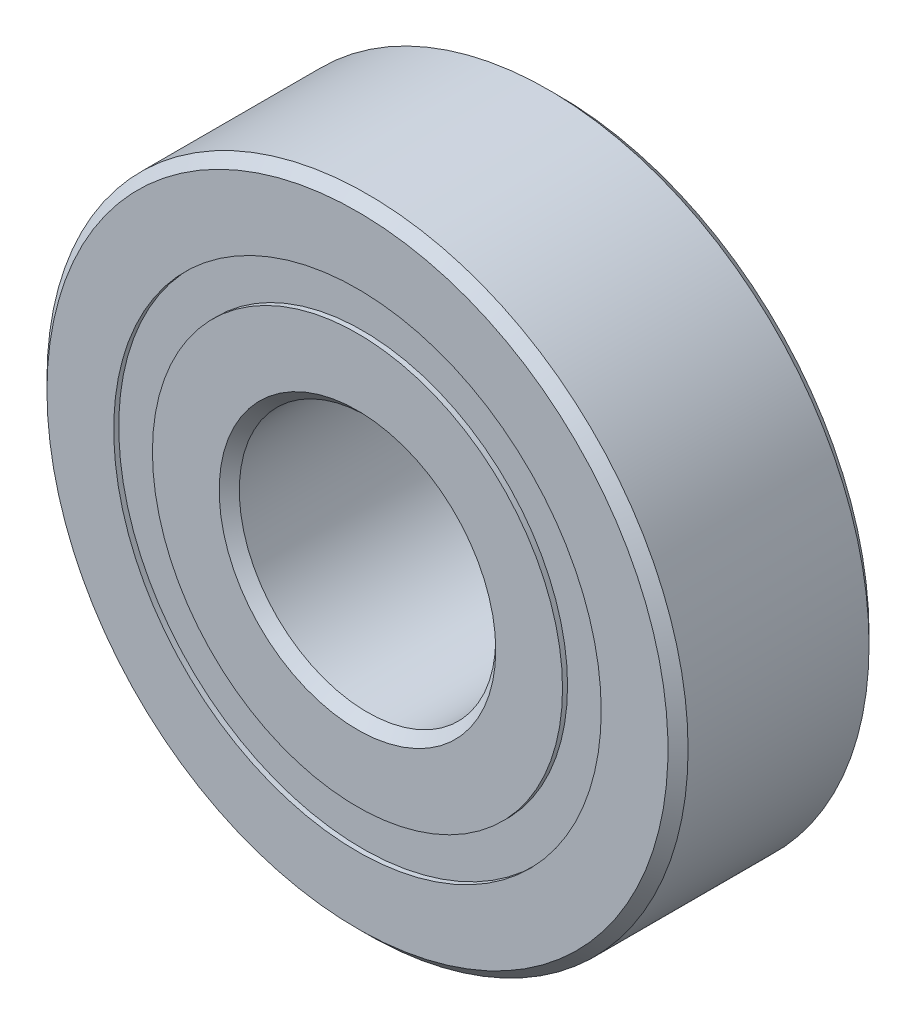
ISO-10303-21;
HEADER;
FILE_DESCRIPTION(('STEP AP214'),'2;1');
FILE_NAME('part.step','',(''),(''),'','','');
FILE_SCHEMA(('AUTOMOTIVE_DESIGN { 1 0 10303 214 1 1 1 1 }'));
ENDSEC;
DATA;
#1=APPLICATION_CONTEXT('core data for automotive mechanical design processes');
#2=APPLICATION_PROTOCOL_DEFINITION('international standard','automotive_design',2000,#1);
#3=PRODUCT_CONTEXT('',#1,'mechanical');
#4=PRODUCT('Part','Part','',(#3));
#5=PRODUCT_RELATED_PRODUCT_CATEGORY('part','',(#4));
#6=PRODUCT_DEFINITION_FORMATION('','',#4);
#7=PRODUCT_DEFINITION_CONTEXT('part definition',#1,'design');
#8=PRODUCT_DEFINITION('design','',#6,#7);
#9=PRODUCT_DEFINITION_SHAPE('','',#8);
#10=(LENGTH_UNIT() NAMED_UNIT(*) SI_UNIT(.MILLI.,.METRE.));
#11=(NAMED_UNIT(*) PLANE_ANGLE_UNIT() SI_UNIT($,.RADIAN.));
#12=(NAMED_UNIT(*) SI_UNIT($,.STERADIAN.) SOLID_ANGLE_UNIT());
#13=UNCERTAINTY_MEASURE_WITH_UNIT(LENGTH_MEASURE(1.E-05),#10,'distance_accuracy_value','');
#14=(GEOMETRIC_REPRESENTATION_CONTEXT(3) GLOBAL_UNCERTAINTY_ASSIGNED_CONTEXT((#13)) GLOBAL_UNIT_ASSIGNED_CONTEXT((#10,
#11,#12)) REPRESENTATION_CONTEXT('',''));
#15=CARTESIAN_POINT('',(0.,0.,0.));
#16=DIRECTION('',(0.,0.,1.));
#17=DIRECTION('',(1.,0.,0.));
#18=AXIS2_PLACEMENT_3D('',#15,#16,#17);
#19=CARTESIAN_POINT('',(0.,6.03522142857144,-2.36474));
#20=DIRECTION('',(0.,0.,0.999999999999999));
#21=DIRECTION('',(1.,0.,0.));
#22=AXIS2_PLACEMENT_3D('',#19,#20,#21);
#23=PLANE('',#22);
#24=CARTESIAN_POINT('',(0.,0.,-2.36474));
#25=DIRECTION('',(0.,0.,0.999999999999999));
#26=DIRECTION('',(1.,0.,0.));
#27=AXIS2_PLACEMENT_3D('',#24,#25,#26);
#28=CIRCLE('',#27,6.03522142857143);
#29=CARTESIAN_POINT('',(6.03522142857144,0.,-2.36474));
#30=VERTEX_POINT('',#29);
#31=EDGE_CURVE('E57',#30,#30,#28,.T.);
#32=ORIENTED_EDGE('',*,*,#31,.F.);
#33=EDGE_LOOP('',(#32));
#34=FACE_BOUND('',#33,.T.);
#35=CARTESIAN_POINT('',(0.,0.,-2.36474));
#36=DIRECTION('',(0.,0.,0.999999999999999));
#37=DIRECTION('',(1.,0.,0.));
#38=AXIS2_PLACEMENT_3D('',#35,#36,#37);
#39=CIRCLE('',#38,5.07727857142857);
#40=CARTESIAN_POINT('',(5.07727857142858,0.,-2.36474));
#41=VERTEX_POINT('',#40);
#42=EDGE_CURVE('E11',#41,#41,#39,.T.);
#43=ORIENTED_EDGE('',*,*,#42,.T.);
#44=EDGE_LOOP('',(#43));
#45=FACE_BOUND('',#44,.T.);
#46=ADVANCED_FACE('F43',(#34,#45),#23,.F.);
#47=CARTESIAN_POINT('',(0.,0.,2.4892));
#48=DIRECTION('',(0.,0.,0.999999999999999));
#49=DIRECTION('',(1.,0.,0.));
#50=AXIS2_PLACEMENT_3D('',#47,#48,#49);
#51=CYLINDRICAL_SURFACE('',#50,5.07727857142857);
#52=CARTESIAN_POINT('',(0.,0.,-1.20554465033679));
#53=DIRECTION('',(0.,0.,0.999999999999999));
#54=DIRECTION('',(1.,0.,0.));
#55=AXIS2_PLACEMENT_3D('',#52,#53,#54);
#56=CIRCLE('',#55,5.07727857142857);
#57=CARTESIAN_POINT('',(5.07727857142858,0.,-1.20554465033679));
#58=VERTEX_POINT('',#57);
#59=EDGE_CURVE('E49',#58,#58,#56,.T.);
#60=CARTESIAN_POINT('',(5.07727857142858,0.,-2.36474));
#61=CARTESIAN_POINT('',(5.07727857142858,0.,-2.35266504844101));
#62=CARTESIAN_POINT('',(5.07727857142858,0.,-2.34059009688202));
#63=CARTESIAN_POINT('',(5.07727857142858,0.,-2.31644019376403));
#64=CARTESIAN_POINT('',(5.07727857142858,0.,-2.30436524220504));
#65=CARTESIAN_POINT('',(5.07727857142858,0.,-2.28021533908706));
#66=CARTESIAN_POINT('',(5.07727857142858,0.,-2.26814038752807));
#67=CARTESIAN_POINT('',(5.07727857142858,0.,-2.24399048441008));
#68=CARTESIAN_POINT('',(5.07727857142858,0.,-2.23191553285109));
#69=CARTESIAN_POINT('',(5.07727857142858,0.,-2.20776562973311));
#70=CARTESIAN_POINT('',(5.07727857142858,0.,-2.19569067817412));
#71=CARTESIAN_POINT('',(5.07727857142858,0.,-2.17154077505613));
#72=CARTESIAN_POINT('',(5.07727857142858,0.,-2.15946582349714));
#73=CARTESIAN_POINT('',(5.07727857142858,0.,-2.13531592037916));
#74=CARTESIAN_POINT('',(5.07727857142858,0.,-2.12324096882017));
#75=CARTESIAN_POINT('',(5.07727857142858,0.,-2.09909106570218));
#76=CARTESIAN_POINT('',(5.07727857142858,0.,-2.08701611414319));
#77=CARTESIAN_POINT('',(5.07727857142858,0.,-2.06286621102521));
#78=CARTESIAN_POINT('',(5.07727857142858,0.,-2.05079125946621));
#79=CARTESIAN_POINT('',(5.07727857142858,0.,-2.02664135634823));
#80=CARTESIAN_POINT('',(5.07727857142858,0.,-2.01456640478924));
#81=CARTESIAN_POINT('',(5.07727857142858,0.,-1.99041650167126));
#82=CARTESIAN_POINT('',(5.07727857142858,0.,-1.97834155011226));
#83=CARTESIAN_POINT('',(5.07727857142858,0.,-1.95419164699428));
#84=CARTESIAN_POINT('',(5.07727857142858,0.,-1.94211669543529));
#85=CARTESIAN_POINT('',(5.07727857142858,0.,-1.91796679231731));
#86=CARTESIAN_POINT('',(5.07727857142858,0.,-1.90589184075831));
#87=CARTESIAN_POINT('',(5.07727857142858,0.,-1.88174193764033));
#88=CARTESIAN_POINT('',(5.07727857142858,0.,-1.86966698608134));
#89=CARTESIAN_POINT('',(5.07727857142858,0.,-1.84551708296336));
#90=CARTESIAN_POINT('',(5.07727857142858,0.,-1.83344213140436));
#91=CARTESIAN_POINT('',(5.07727857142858,0.,-1.80929222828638));
#92=CARTESIAN_POINT('',(5.07727857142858,0.,-1.79721727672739));
#93=CARTESIAN_POINT('',(5.07727857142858,0.,-1.7730673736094));
#94=CARTESIAN_POINT('',(5.07727857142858,0.,-1.76099242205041));
#95=CARTESIAN_POINT('',(5.07727857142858,0.,-1.73684251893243));
#96=CARTESIAN_POINT('',(5.07727857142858,0.,-1.72476756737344));
#97=CARTESIAN_POINT('',(5.07727857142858,0.,-1.70061766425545));
#98=CARTESIAN_POINT('',(5.07727857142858,0.,-1.68854271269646));
#99=CARTESIAN_POINT('',(5.07727857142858,0.,-1.66439280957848));
#100=CARTESIAN_POINT('',(5.07727857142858,0.,-1.65231785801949));
#101=CARTESIAN_POINT('',(5.07727857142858,0.,-1.6281679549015));
#102=CARTESIAN_POINT('',(5.07727857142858,0.,-1.61609300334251));
#103=CARTESIAN_POINT('',(5.07727857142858,0.,-1.59194310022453));
#104=CARTESIAN_POINT('',(5.07727857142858,0.,-1.57986814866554));
#105=CARTESIAN_POINT('',(5.07727857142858,0.,-1.55571824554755));
#106=CARTESIAN_POINT('',(5.07727857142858,0.,-1.54364329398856));
#107=CARTESIAN_POINT('',(5.07727857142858,0.,-1.51949339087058));
#108=CARTESIAN_POINT('',(5.07727857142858,0.,-1.50741843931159));
#109=CARTESIAN_POINT('',(5.07727857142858,0.,-1.4832685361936));
#110=CARTESIAN_POINT('',(5.07727857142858,0.,-1.47119358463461));
#111=CARTESIAN_POINT('',(5.07727857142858,0.,-1.44704368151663));
#112=CARTESIAN_POINT('',(5.07727857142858,0.,-1.43496872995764));
#113=CARTESIAN_POINT('',(5.07727857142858,0.,-1.41081882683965));
#114=CARTESIAN_POINT('',(5.07727857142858,0.,-1.39874387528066));
#115=CARTESIAN_POINT('',(5.07727857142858,0.,-1.37459397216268));
#116=CARTESIAN_POINT('',(5.07727857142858,0.,-1.36251902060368));
#117=CARTESIAN_POINT('',(5.07727857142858,0.,-1.3383691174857));
#118=CARTESIAN_POINT('',(5.07727857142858,0.,-1.32629416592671));
#119=CARTESIAN_POINT('',(5.07727857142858,0.,-1.30214426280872));
#120=CARTESIAN_POINT('',(5.07727857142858,0.,-1.29006931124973));
#121=CARTESIAN_POINT('',(5.07727857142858,0.,-1.26591940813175));
#122=CARTESIAN_POINT('',(5.07727857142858,0.,-1.25384445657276));
#123=CARTESIAN_POINT('',(5.07727857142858,0.,-1.22969455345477));
#124=CARTESIAN_POINT('',(5.07727857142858,0.,-1.21761960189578));
#125=CARTESIAN_POINT('',(5.07727857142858,0.,-1.20554465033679));
#126=B_SPLINE_CURVE_WITH_KNOTS('',3,(#60,#61,#62,#63,#64,#65,#66,#67,#68,#69,#70,#71,#72,#73,
#74,#75,#76,#77,#78,#79,#80,#81,#82,#83,#84,#85,#86,#87,#88,#89,#90,#91,#92,#93,#94,#95,#96,#97,
#98,#99,#100,#101,#102,#103,#104,#105,#106,#107,#108,#109,#110,#111,#112,#113,#114,#115,#116,
#117,#118,#119,#120,#121,#122,#123,#124,#125),.UNSPECIFIED.,.F.,.F.,(4,2,2,2,2,2,2,2,2,2,2,2,2,
2,2,2,2,2,2,2,2,2,2,2,2,2,2,2,2,2,2,2,4),(0.,0.0362248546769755,0.0724497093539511,
0.108674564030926,0.144899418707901,0.181124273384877,0.217349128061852,0.253573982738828,
0.289798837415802,0.326023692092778,0.362248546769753,0.398473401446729,0.434698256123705,
0.470923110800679,0.507147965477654,0.543372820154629,0.579597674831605,0.61582252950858,
0.652047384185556,0.688272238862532,0.724497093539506,0.760721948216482,0.796946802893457,
0.833171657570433,0.869396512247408,0.905621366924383,0.941846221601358,0.978071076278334,
1.01429593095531,1.05052078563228,1.08674564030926,1.12297049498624,1.15919534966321),.UNSPECIFIED.);
#127=EDGE_CURVE('BSEAM66',#41,#58,#126,.T.);
#128=ORIENTED_EDGE('',*,*,#42,.F.);
#129=ORIENTED_EDGE('',*,*,#59,.T.);
#130=ORIENTED_EDGE('',*,*,#127,.T.);
#131=ORIENTED_EDGE('',*,*,#127,.F.);
#132=EDGE_LOOP('',(#128,#130,#129,#131));
#133=FACE_BOUND('',#132,.T.);
#134=ADVANCED_FACE('F66',(#133),#51,.F.);
#135=CARTESIAN_POINT('',(0.,6.03522142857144,-1.20554465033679));
#136=DIRECTION('',(0.,0.,-0.999999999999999));
#137=DIRECTION('',(-1.,0.,0.));
#138=AXIS2_PLACEMENT_3D('',#135,#136,#137);
#139=PLANE('',#138);
#140=ORIENTED_EDGE('',*,*,#59,.F.);
#141=EDGE_LOOP('',(#140));
#142=FACE_BOUND('',#141,.T.);
#143=CARTESIAN_POINT('',(0.,0.,-1.20554465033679));
#144=DIRECTION('',(0.,0.,0.999999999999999));
#145=DIRECTION('',(1.,0.,0.));
#146=AXIS2_PLACEMENT_3D('',#143,#144,#145);
#147=CIRCLE('',#146,6.03522142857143);
#148=CARTESIAN_POINT('',(6.03522142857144,0.,-1.20554465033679));
#149=VERTEX_POINT('',#148);
#150=EDGE_CURVE('E53',#149,#149,#147,.T.);
#151=ORIENTED_EDGE('',*,*,#150,.T.);
#152=EDGE_LOOP('',(#151));
#153=FACE_BOUND('',#152,.T.);
#154=ADVANCED_FACE('F70',(#142,#153),#139,.F.);
#155=CARTESIAN_POINT('',(0.,0.,2.4892));
#156=DIRECTION('',(0.,0.,0.999999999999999));
#157=DIRECTION('',(1.,0.,0.));
#158=AXIS2_PLACEMENT_3D('',#155,#156,#157);
#159=CYLINDRICAL_SURFACE('',#158,6.03522142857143);
#160=CARTESIAN_POINT('',(6.03522142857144,0.,-1.20554465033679));
#161=CARTESIAN_POINT('',(6.03522142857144,0.,-1.21761960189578));
#162=CARTESIAN_POINT('',(6.03522142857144,0.,-1.22969455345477));
#163=CARTESIAN_POINT('',(6.03522142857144,0.,-1.25384445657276));
#164=CARTESIAN_POINT('',(6.03522142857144,0.,-1.26591940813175));
#165=CARTESIAN_POINT('',(6.03522142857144,0.,-1.29006931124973));
#166=CARTESIAN_POINT('',(6.03522142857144,0.,-1.30214426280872));
#167=CARTESIAN_POINT('',(6.03522142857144,0.,-1.32629416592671));
#168=CARTESIAN_POINT('',(6.03522142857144,0.,-1.3383691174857));
#169=CARTESIAN_POINT('',(6.03522142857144,0.,-1.36251902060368));
#170=CARTESIAN_POINT('',(6.03522142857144,0.,-1.37459397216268));
#171=CARTESIAN_POINT('',(6.03522142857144,0.,-1.39874387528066));
#172=CARTESIAN_POINT('',(6.03522142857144,0.,-1.41081882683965));
#173=CARTESIAN_POINT('',(6.03522142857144,0.,-1.43496872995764));
#174=CARTESIAN_POINT('',(6.03522142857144,0.,-1.44704368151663));
#175=CARTESIAN_POINT('',(6.03522142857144,0.,-1.47119358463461));
#176=CARTESIAN_POINT('',(6.03522142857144,0.,-1.4832685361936));
#177=CARTESIAN_POINT('',(6.03522142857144,0.,-1.50741843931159));
#178=CARTESIAN_POINT('',(6.03522142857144,0.,-1.51949339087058));
#179=CARTESIAN_POINT('',(6.03522142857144,0.,-1.54364329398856));
#180=CARTESIAN_POINT('',(6.03522142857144,0.,-1.55571824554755));
#181=CARTESIAN_POINT('',(6.03522142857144,0.,-1.57986814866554));
#182=CARTESIAN_POINT('',(6.03522142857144,0.,-1.59194310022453));
#183=CARTESIAN_POINT('',(6.03522142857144,0.,-1.61609300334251));
#184=CARTESIAN_POINT('',(6.03522142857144,0.,-1.6281679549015));
#185=CARTESIAN_POINT('',(6.03522142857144,0.,-1.65231785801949));
#186=CARTESIAN_POINT('',(6.03522142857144,0.,-1.66439280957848));
#187=CARTESIAN_POINT('',(6.03522142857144,0.,-1.68854271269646));
#188=CARTESIAN_POINT('',(6.03522142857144,0.,-1.70061766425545));
#189=CARTESIAN_POINT('',(6.03522142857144,0.,-1.72476756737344));
#190=CARTESIAN_POINT('',(6.03522142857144,0.,-1.73684251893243));
#191=CARTESIAN_POINT('',(6.03522142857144,0.,-1.76099242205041));
#192=CARTESIAN_POINT('',(6.03522142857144,0.,-1.7730673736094));
#193=CARTESIAN_POINT('',(6.03522142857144,0.,-1.79721727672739));
#194=CARTESIAN_POINT('',(6.03522142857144,0.,-1.80929222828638));
#195=CARTESIAN_POINT('',(6.03522142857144,0.,-1.83344213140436));
#196=CARTESIAN_POINT('',(6.03522142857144,0.,-1.84551708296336));
#197=CARTESIAN_POINT('',(6.03522142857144,0.,-1.86966698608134));
#198=CARTESIAN_POINT('',(6.03522142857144,0.,-1.88174193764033));
#199=CARTESIAN_POINT('',(6.03522142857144,0.,-1.90589184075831));
#200=CARTESIAN_POINT('',(6.03522142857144,0.,-1.91796679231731));
#201=CARTESIAN_POINT('',(6.03522142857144,0.,-1.94211669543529));
#202=CARTESIAN_POINT('',(6.03522142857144,0.,-1.95419164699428));
#203=CARTESIAN_POINT('',(6.03522142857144,0.,-1.97834155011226));
#204=CARTESIAN_POINT('',(6.03522142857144,0.,-1.99041650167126));
#205=CARTESIAN_POINT('',(6.03522142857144,0.,-2.01456640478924));
#206=CARTESIAN_POINT('',(6.03522142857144,0.,-2.02664135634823));
#207=CARTESIAN_POINT('',(6.03522142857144,0.,-2.05079125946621));
#208=CARTESIAN_POINT('',(6.03522142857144,0.,-2.06286621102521));
#209=CARTESIAN_POINT('',(6.03522142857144,0.,-2.08701611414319));
#210=CARTESIAN_POINT('',(6.03522142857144,0.,-2.09909106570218));
#211=CARTESIAN_POINT('',(6.03522142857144,0.,-2.12324096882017));
#212=CARTESIAN_POINT('',(6.03522142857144,0.,-2.13531592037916));
#213=CARTESIAN_POINT('',(6.03522142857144,0.,-2.15946582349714));
#214=CARTESIAN_POINT('',(6.03522142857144,0.,-2.17154077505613));
#215=CARTESIAN_POINT('',(6.03522142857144,0.,-2.19569067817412));
#216=CARTESIAN_POINT('',(6.03522142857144,0.,-2.20776562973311));
#217=CARTESIAN_POINT('',(6.03522142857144,0.,-2.23191553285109));
#218=CARTESIAN_POINT('',(6.03522142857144,0.,-2.24399048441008));
#219=CARTESIAN_POINT('',(6.03522142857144,0.,-2.26814038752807));
#220=CARTESIAN_POINT('',(6.03522142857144,0.,-2.28021533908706));
#221=CARTESIAN_POINT('',(6.03522142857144,0.,-2.30436524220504));
#222=CARTESIAN_POINT('',(6.03522142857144,0.,-2.31644019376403));
#223=CARTESIAN_POINT('',(6.03522142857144,0.,-2.34059009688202));
#224=CARTESIAN_POINT('',(6.03522142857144,0.,-2.35266504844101));
#225=CARTESIAN_POINT('',(6.03522142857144,0.,-2.36474));
#226=B_SPLINE_CURVE_WITH_KNOTS('',3,(#160,#161,#162,#163,#164,#165,#166,#167,#168,#169,#170,
#171,#172,#173,#174,#175,#176,#177,#178,#179,#180,#181,#182,#183,#184,#185,#186,#187,#188,#189,
#190,#191,#192,#193,#194,#195,#196,#197,#198,#199,#200,#201,#202,#203,#204,#205,#206,#207,#208,
#209,#210,#211,#212,#213,#214,#215,#216,#217,#218,#219,#220,#221,#222,#223,#224,#225),
.UNSPECIFIED.,.F.,.F.,(4,2,2,2,2,2,2,2,2,2,2,2,2,2,2,2,2,2,2,2,2,2,2,2,2,2,2,2,2,2,2,2,4),(0.,
0.0362248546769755,0.0724497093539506,0.108674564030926,0.144899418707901,0.181124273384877,
0.217349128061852,0.253573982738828,0.289798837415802,0.326023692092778,0.362248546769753,
0.398473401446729,0.434698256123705,0.47092311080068,0.507147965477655,0.54337282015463,
0.579597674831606,0.615822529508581,0.652047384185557,0.688272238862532,0.724497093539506,
0.760721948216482,0.796946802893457,0.833171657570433,0.869396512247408,0.905621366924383,
0.941846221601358,0.978071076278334,1.01429593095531,1.05052078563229,1.08674564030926,
1.12297049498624,1.15919534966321),.UNSPECIFIED.);
#227=EDGE_CURVE('BSEAM63',#149,#30,#226,.T.);
#228=ORIENTED_EDGE('',*,*,#150,.F.);
#229=ORIENTED_EDGE('',*,*,#31,.T.);
#230=ORIENTED_EDGE('',*,*,#227,.T.);
#231=ORIENTED_EDGE('',*,*,#227,.F.);
#232=EDGE_LOOP('',(#228,#230,#229,#231));
#233=FACE_BOUND('',#232,.T.);
#234=ADVANCED_FACE('F63',(#233),#159,.T.);
#235=CLOSED_SHELL('',(#46,#134,#154,#234));
#236=MANIFOLD_SOLID_BREP('B2',#235);
#237=CARTESIAN_POINT('',(0.,6.03522142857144,2.36474));
#238=DIRECTION('',(0.,0.,-0.999999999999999));
#239=DIRECTION('',(-1.,0.,0.));
#240=AXIS2_PLACEMENT_3D('',#237,#238,#239);
#241=PLANE('',#240);
#242=CARTESIAN_POINT('',(0.,0.,2.36474));
#243=DIRECTION('',(0.,0.,0.999999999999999));
#244=DIRECTION('',(1.,0.,0.));
#245=AXIS2_PLACEMENT_3D('',#242,#243,#244);
#246=CIRCLE('',#245,5.07727857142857);
#247=CARTESIAN_POINT('',(5.07727857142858,0.,2.36474));
#248=VERTEX_POINT('',#247);
#249=EDGE_CURVE('E42',#248,#248,#246,.T.);
#250=ORIENTED_EDGE('',*,*,#249,.F.);
#251=EDGE_LOOP('',(#250));
#252=FACE_BOUND('',#251,.T.);
#253=CARTESIAN_POINT('',(0.,0.,2.36474));
#254=DIRECTION('',(0.,0.,0.999999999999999));
#255=DIRECTION('',(1.,0.,0.));
#256=AXIS2_PLACEMENT_3D('',#253,#254,#255);
#257=CIRCLE('',#256,6.03522142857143);
#258=CARTESIAN_POINT('',(6.03522142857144,0.,2.36474));
#259=VERTEX_POINT('',#258);
#260=EDGE_CURVE('E124',#259,#259,#257,.T.);
#261=ORIENTED_EDGE('',*,*,#260,.T.);
#262=EDGE_LOOP('',(#261));
#263=FACE_BOUND('',#262,.T.);
#264=ADVANCED_FACE('F110',(#252,#263),#241,.F.);
#265=CARTESIAN_POINT('',(0.,0.,2.4892));
#266=DIRECTION('',(0.,0.,0.999999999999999));
#267=DIRECTION('',(1.,0.,0.));
#268=AXIS2_PLACEMENT_3D('',#265,#266,#267);
#269=CYLINDRICAL_SURFACE('',#268,5.07727857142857);
#270=CARTESIAN_POINT('',(0.,0.,1.20554465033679));
#271=DIRECTION('',(0.,0.,0.999999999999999));
#272=DIRECTION('',(1.,0.,0.));
#273=AXIS2_PLACEMENT_3D('',#270,#271,#272);
#274=CIRCLE('',#273,5.07727857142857);
#275=CARTESIAN_POINT('',(5.07727857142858,0.,1.20554465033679));
#276=VERTEX_POINT('',#275);
#277=EDGE_CURVE('E116',#276,#276,#274,.T.);
#278=CARTESIAN_POINT('',(5.07727857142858,0.,1.20554465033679));
#279=CARTESIAN_POINT('',(5.07727857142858,0.,1.21761960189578));
#280=CARTESIAN_POINT('',(5.07727857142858,0.,1.22969455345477));
#281=CARTESIAN_POINT('',(5.07727857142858,0.,1.25384445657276));
#282=CARTESIAN_POINT('',(5.07727857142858,0.,1.26591940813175));
#283=CARTESIAN_POINT('',(5.07727857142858,0.,1.29006931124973));
#284=CARTESIAN_POINT('',(5.07727857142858,0.,1.30214426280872));
#285=CARTESIAN_POINT('',(5.07727857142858,0.,1.32629416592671));
#286=CARTESIAN_POINT('',(5.07727857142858,0.,1.3383691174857));
#287=CARTESIAN_POINT('',(5.07727857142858,0.,1.36251902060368));
#288=CARTESIAN_POINT('',(5.07727857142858,0.,1.37459397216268));
#289=CARTESIAN_POINT('',(5.07727857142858,0.,1.39874387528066));
#290=CARTESIAN_POINT('',(5.07727857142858,0.,1.41081882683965));
#291=CARTESIAN_POINT('',(5.07727857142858,0.,1.43496872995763));
#292=CARTESIAN_POINT('',(5.07727857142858,0.,1.44704368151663));
#293=CARTESIAN_POINT('',(5.07727857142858,0.,1.47119358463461));
#294=CARTESIAN_POINT('',(5.07727857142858,0.,1.4832685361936));
#295=CARTESIAN_POINT('',(5.07727857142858,0.,1.50741843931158));
#296=CARTESIAN_POINT('',(5.07727857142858,0.,1.51949339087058));
#297=CARTESIAN_POINT('',(5.07727857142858,0.,1.54364329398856));
#298=CARTESIAN_POINT('',(5.07727857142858,0.,1.55571824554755));
#299=CARTESIAN_POINT('',(5.07727857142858,0.,1.57986814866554));
#300=CARTESIAN_POINT('',(5.07727857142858,0.,1.59194310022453));
#301=CARTESIAN_POINT('',(5.07727857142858,0.,1.61609300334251));
#302=CARTESIAN_POINT('',(5.07727857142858,0.,1.6281679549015));
#303=CARTESIAN_POINT('',(5.07727857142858,0.,1.65231785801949));
#304=CARTESIAN_POINT('',(5.07727857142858,0.,1.66439280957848));
#305=CARTESIAN_POINT('',(5.07727857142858,0.,1.68854271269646));
#306=CARTESIAN_POINT('',(5.07727857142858,0.,1.70061766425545));
#307=CARTESIAN_POINT('',(5.07727857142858,0.,1.72476756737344));
#308=CARTESIAN_POINT('',(5.07727857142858,0.,1.73684251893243));
#309=CARTESIAN_POINT('',(5.07727857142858,0.,1.76099242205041));
#310=CARTESIAN_POINT('',(5.07727857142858,0.,1.7730673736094));
#311=CARTESIAN_POINT('',(5.07727857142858,0.,1.79721727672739));
#312=CARTESIAN_POINT('',(5.07727857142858,0.,1.80929222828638));
#313=CARTESIAN_POINT('',(5.07727857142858,0.,1.83344213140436));
#314=CARTESIAN_POINT('',(5.07727857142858,0.,1.84551708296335));
#315=CARTESIAN_POINT('',(5.07727857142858,0.,1.86966698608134));
#316=CARTESIAN_POINT('',(5.07727857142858,0.,1.88174193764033));
#317=CARTESIAN_POINT('',(5.07727857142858,0.,1.90589184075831));
#318=CARTESIAN_POINT('',(5.07727857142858,0.,1.9179667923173));
#319=CARTESIAN_POINT('',(5.07727857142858,0.,1.94211669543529));
#320=CARTESIAN_POINT('',(5.07727857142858,0.,1.95419164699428));
#321=CARTESIAN_POINT('',(5.07727857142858,0.,1.97834155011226));
#322=CARTESIAN_POINT('',(5.07727857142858,0.,1.99041650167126));
#323=CARTESIAN_POINT('',(5.07727857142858,0.,2.01456640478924));
#324=CARTESIAN_POINT('',(5.07727857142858,0.,2.02664135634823));
#325=CARTESIAN_POINT('',(5.07727857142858,0.,2.05079125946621));
#326=CARTESIAN_POINT('',(5.07727857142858,0.,2.06286621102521));
#327=CARTESIAN_POINT('',(5.07727857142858,0.,2.08701611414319));
#328=CARTESIAN_POINT('',(5.07727857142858,0.,2.09909106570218));
#329=CARTESIAN_POINT('',(5.07727857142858,0.,2.12324096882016));
#330=CARTESIAN_POINT('',(5.07727857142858,0.,2.13531592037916));
#331=CARTESIAN_POINT('',(5.07727857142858,0.,2.15946582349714));
#332=CARTESIAN_POINT('',(5.07727857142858,0.,2.17154077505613));
#333=CARTESIAN_POINT('',(5.07727857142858,0.,2.19569067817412));
#334=CARTESIAN_POINT('',(5.07727857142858,0.,2.20776562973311));
#335=CARTESIAN_POINT('',(5.07727857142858,0.,2.23191553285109));
#336=CARTESIAN_POINT('',(5.07727857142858,0.,2.24399048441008));
#337=CARTESIAN_POINT('',(5.07727857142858,0.,2.26814038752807));
#338=CARTESIAN_POINT('',(5.07727857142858,0.,2.28021533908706));
#339=CARTESIAN_POINT('',(5.07727857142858,0.,2.30436524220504));
#340=CARTESIAN_POINT('',(5.07727857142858,0.,2.31644019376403));
#341=CARTESIAN_POINT('',(5.07727857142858,0.,2.34059009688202));
#342=CARTESIAN_POINT('',(5.07727857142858,0.,2.35266504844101));
#343=CARTESIAN_POINT('',(5.07727857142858,0.,2.36474));
#344=B_SPLINE_CURVE_WITH_KNOTS('',3,(#278,#279,#280,#281,#282,#283,#284,#285,#286,#287,#288,
#289,#290,#291,#292,#293,#294,#295,#296,#297,#298,#299,#300,#301,#302,#303,#304,#305,#306,#307,
#308,#309,#310,#311,#312,#313,#314,#315,#316,#317,#318,#319,#320,#321,#322,#323,#324,#325,#326,
#327,#328,#329,#330,#331,#332,#333,#334,#335,#336,#337,#338,#339,#340,#341,#342,#343),
.UNSPECIFIED.,.F.,.F.,(4,2,2,2,2,2,2,2,2,2,2,2,2,2,2,2,2,2,2,2,2,2,2,2,2,2,2,2,2,2,2,2,4),(0.,
0.0362248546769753,0.0724497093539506,0.108674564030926,0.144899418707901,0.181124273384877,
0.217349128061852,0.253573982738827,0.289798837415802,0.326023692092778,0.362248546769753,
0.398473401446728,0.434698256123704,0.470923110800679,0.507147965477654,0.54337282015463,
0.579597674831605,0.61582252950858,0.652047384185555,0.688272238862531,0.724497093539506,
0.760721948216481,0.796946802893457,0.833171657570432,0.869396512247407,0.905621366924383,
0.941846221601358,0.978071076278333,1.01429593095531,1.05052078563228,1.08674564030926,
1.12297049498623,1.15919534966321),.UNSPECIFIED.);
#345=EDGE_CURVE('BSEAM139',#276,#248,#344,.T.);
#346=ORIENTED_EDGE('',*,*,#277,.F.);
#347=ORIENTED_EDGE('',*,*,#249,.T.);
#348=ORIENTED_EDGE('',*,*,#345,.T.);
#349=ORIENTED_EDGE('',*,*,#345,.F.);
#350=EDGE_LOOP('',(#346,#348,#347,#349));
#351=FACE_BOUND('',#350,.T.);
#352=ADVANCED_FACE('F139',(#351),#269,.F.);
#353=CARTESIAN_POINT('',(0.,6.03522142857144,1.20554465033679));
#354=DIRECTION('',(0.,0.,0.999999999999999));
#355=DIRECTION('',(1.,0.,0.));
#356=AXIS2_PLACEMENT_3D('',#353,#354,#355);
#357=PLANE('',#356);
#358=CARTESIAN_POINT('',(0.,0.,1.20554465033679));
#359=DIRECTION('',(0.,0.,0.999999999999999));
#360=DIRECTION('',(1.,0.,0.));
#361=AXIS2_PLACEMENT_3D('',#358,#359,#360);
#362=CIRCLE('',#361,6.03522142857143);
#363=CARTESIAN_POINT('',(6.03522142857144,0.,1.20554465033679));
#364=VERTEX_POINT('',#363);
#365=EDGE_CURVE('E120',#364,#364,#362,.T.);
#366=ORIENTED_EDGE('',*,*,#365,.F.);
#367=EDGE_LOOP('',(#366));
#368=FACE_BOUND('',#367,.T.);
#369=ORIENTED_EDGE('',*,*,#277,.T.);
#370=EDGE_LOOP('',(#369));
#371=FACE_BOUND('',#370,.T.);
#372=ADVANCED_FACE('F134',(#368,#371),#357,.F.);
#373=CARTESIAN_POINT('',(0.,0.,2.4892));
#374=DIRECTION('',(0.,0.,0.999999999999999));
#375=DIRECTION('',(1.,0.,0.));
#376=AXIS2_PLACEMENT_3D('',#373,#374,#375);
#377=CYLINDRICAL_SURFACE('',#376,6.03522142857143);
#378=CARTESIAN_POINT('',(6.03522142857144,0.,2.36474));
#379=CARTESIAN_POINT('',(6.03522142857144,0.,2.35266504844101));
#380=CARTESIAN_POINT('',(6.03522142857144,0.,2.34059009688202));
#381=CARTESIAN_POINT('',(6.03522142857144,0.,2.31644019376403));
#382=CARTESIAN_POINT('',(6.03522142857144,0.,2.30436524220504));
#383=CARTESIAN_POINT('',(6.03522142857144,0.,2.28021533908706));
#384=CARTESIAN_POINT('',(6.03522142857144,0.,2.26814038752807));
#385=CARTESIAN_POINT('',(6.03522142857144,0.,2.24399048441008));
#386=CARTESIAN_POINT('',(6.03522142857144,0.,2.23191553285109));
#387=CARTESIAN_POINT('',(6.03522142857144,0.,2.20776562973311));
#388=CARTESIAN_POINT('',(6.03522142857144,0.,2.19569067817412));
#389=CARTESIAN_POINT('',(6.03522142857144,0.,2.17154077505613));
#390=CARTESIAN_POINT('',(6.03522142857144,0.,2.15946582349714));
#391=CARTESIAN_POINT('',(6.03522142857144,0.,2.13531592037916));
#392=CARTESIAN_POINT('',(6.03522142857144,0.,2.12324096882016));
#393=CARTESIAN_POINT('',(6.03522142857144,0.,2.09909106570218));
#394=CARTESIAN_POINT('',(6.03522142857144,0.,2.08701611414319));
#395=CARTESIAN_POINT('',(6.03522142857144,0.,2.06286621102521));
#396=CARTESIAN_POINT('',(6.03522142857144,0.,2.05079125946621));
#397=CARTESIAN_POINT('',(6.03522142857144,0.,2.02664135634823));
#398=CARTESIAN_POINT('',(6.03522142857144,0.,2.01456640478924));
#399=CARTESIAN_POINT('',(6.03522142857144,0.,1.99041650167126));
#400=CARTESIAN_POINT('',(6.03522142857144,0.,1.97834155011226));
#401=CARTESIAN_POINT('',(6.03522142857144,0.,1.95419164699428));
#402=CARTESIAN_POINT('',(6.03522142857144,0.,1.94211669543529));
#403=CARTESIAN_POINT('',(6.03522142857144,0.,1.9179667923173));
#404=CARTESIAN_POINT('',(6.03522142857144,0.,1.90589184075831));
#405=CARTESIAN_POINT('',(6.03522142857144,0.,1.88174193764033));
#406=CARTESIAN_POINT('',(6.03522142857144,0.,1.86966698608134));
#407=CARTESIAN_POINT('',(6.03522142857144,0.,1.84551708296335));
#408=CARTESIAN_POINT('',(6.03522142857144,0.,1.83344213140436));
#409=CARTESIAN_POINT('',(6.03522142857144,0.,1.80929222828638));
#410=CARTESIAN_POINT('',(6.03522142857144,0.,1.79721727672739));
#411=CARTESIAN_POINT('',(6.03522142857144,0.,1.7730673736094));
#412=CARTESIAN_POINT('',(6.03522142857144,0.,1.76099242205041));
#413=CARTESIAN_POINT('',(6.03522142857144,0.,1.73684251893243));
#414=CARTESIAN_POINT('',(6.03522142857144,0.,1.72476756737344));
#415=CARTESIAN_POINT('',(6.03522142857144,0.,1.70061766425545));
#416=CARTESIAN_POINT('',(6.03522142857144,0.,1.68854271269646));
#417=CARTESIAN_POINT('',(6.03522142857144,0.,1.66439280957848));
#418=CARTESIAN_POINT('',(6.03522142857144,0.,1.65231785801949));
#419=CARTESIAN_POINT('',(6.03522142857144,0.,1.6281679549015));
#420=CARTESIAN_POINT('',(6.03522142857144,0.,1.61609300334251));
#421=CARTESIAN_POINT('',(6.03522142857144,0.,1.59194310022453));
#422=CARTESIAN_POINT('',(6.03522142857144,0.,1.57986814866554));
#423=CARTESIAN_POINT('',(6.03522142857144,0.,1.55571824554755));
#424=CARTESIAN_POINT('',(6.03522142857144,0.,1.54364329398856));
#425=CARTESIAN_POINT('',(6.03522142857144,0.,1.51949339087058));
#426=CARTESIAN_POINT('',(6.03522142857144,0.,1.50741843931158));
#427=CARTESIAN_POINT('',(6.03522142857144,0.,1.4832685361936));
#428=CARTESIAN_POINT('',(6.03522142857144,0.,1.47119358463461));
#429=CARTESIAN_POINT('',(6.03522142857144,0.,1.44704368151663));
#430=CARTESIAN_POINT('',(6.03522142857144,0.,1.43496872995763));
#431=CARTESIAN_POINT('',(6.03522142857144,0.,1.41081882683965));
#432=CARTESIAN_POINT('',(6.03522142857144,0.,1.39874387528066));
#433=CARTESIAN_POINT('',(6.03522142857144,0.,1.37459397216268));
#434=CARTESIAN_POINT('',(6.03522142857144,0.,1.36251902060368));
#435=CARTESIAN_POINT('',(6.03522142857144,0.,1.3383691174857));
#436=CARTESIAN_POINT('',(6.03522142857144,0.,1.32629416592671));
#437=CARTESIAN_POINT('',(6.03522142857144,0.,1.30214426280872));
#438=CARTESIAN_POINT('',(6.03522142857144,0.,1.29006931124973));
#439=CARTESIAN_POINT('',(6.03522142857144,0.,1.26591940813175));
#440=CARTESIAN_POINT('',(6.03522142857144,0.,1.25384445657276));
#441=CARTESIAN_POINT('',(6.03522142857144,0.,1.22969455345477));
#442=CARTESIAN_POINT('',(6.03522142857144,0.,1.21761960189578));
#443=CARTESIAN_POINT('',(6.03522142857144,0.,1.20554465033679));
#444=B_SPLINE_CURVE_WITH_KNOTS('',3,(#378,#379,#380,#381,#382,#383,#384,#385,#386,#387,#388,
#389,#390,#391,#392,#393,#394,#395,#396,#397,#398,#399,#400,#401,#402,#403,#404,#405,#406,#407,
#408,#409,#410,#411,#412,#413,#414,#415,#416,#417,#418,#419,#420,#421,#422,#423,#424,#425,#426,
#427,#428,#429,#430,#431,#432,#433,#434,#435,#436,#437,#438,#439,#440,#441,#442,#443),
.UNSPECIFIED.,.F.,.F.,(4,2,2,2,2,2,2,2,2,2,2,2,2,2,2,2,2,2,2,2,2,2,2,2,2,2,2,2,2,2,2,2,4),(0.,
0.0362248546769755,0.0724497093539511,0.108674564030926,0.144899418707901,0.181124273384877,
0.217349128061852,0.253573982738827,0.289798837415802,0.326023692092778,0.362248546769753,
0.398473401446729,0.434698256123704,0.470923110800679,0.507147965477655,0.54337282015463,
0.579597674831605,0.61582252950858,0.652047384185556,0.688272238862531,0.724497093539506,
0.760721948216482,0.796946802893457,0.833171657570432,0.869396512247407,0.905621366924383,
0.941846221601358,0.978071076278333,1.01429593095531,1.05052078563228,1.08674564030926,
1.12297049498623,1.15919534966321),.UNSPECIFIED.);
#445=EDGE_CURVE('BSEAM131',#259,#364,#444,.T.);
#446=ORIENTED_EDGE('',*,*,#260,.F.);
#447=ORIENTED_EDGE('',*,*,#365,.T.);
#448=ORIENTED_EDGE('',*,*,#445,.T.);
#449=ORIENTED_EDGE('',*,*,#445,.F.);
#450=EDGE_LOOP('',(#446,#448,#447,#449));
#451=FACE_BOUND('',#450,.T.);
#452=ADVANCED_FACE('F131',(#451),#377,.T.);
#453=CLOSED_SHELL('',(#264,#352,#372,#452));
#454=MANIFOLD_SOLID_BREP('B6',#453);
#455=CARTESIAN_POINT('',(-3.92886205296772,3.9288620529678,0.));
#456=DIRECTION('',(0.,0.,0.999999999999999));
#457=DIRECTION('',(-0.70710678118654,0.707106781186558,0.));
#458=AXIS2_PLACEMENT_3D('',#455,#456,#457);
#459=SPHERICAL_SURFACE('',#458,1.20554465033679);
#460=CARTESIAN_POINT('',(-3.92886205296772,3.9288620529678,1.20554465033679));
#461=VERTEX_POINT('',#460);
#462=VERTEX_LOOP('',#461);
#463=FACE_BOUND('',#462,.T.);
#464=ADVANCED_FACE('F177',(#463),#459,.T.);
#465=CLOSED_SHELL('',(#464));
#466=MANIFOLD_SOLID_BREP('B37',#465);
#467=CARTESIAN_POINT('',(-5.55625000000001,0.,0.));
#468=DIRECTION('',(0.,0.,0.999999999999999));
#469=DIRECTION('',(-1.,0.,0.));
#470=AXIS2_PLACEMENT_3D('',#467,#468,#469);
#471=SPHERICAL_SURFACE('',#470,1.20554465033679);
#472=CARTESIAN_POINT('',(-5.55625000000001,0.,1.2055446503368));
#473=VERTEX_POINT('',#472);
#474=VERTEX_LOOP('',#473);
#475=FACE_BOUND('',#474,.T.);
#476=ADVANCED_FACE('F197',(#475),#471,.T.);
#477=CLOSED_SHELL('',(#476));
#478=MANIFOLD_SOLID_BREP('B106',#477);
#479=CARTESIAN_POINT('',(-3.9288620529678,-3.92886205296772,0.));
#480=DIRECTION('',(0.,0.,0.999999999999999));
#481=DIRECTION('',(-0.707106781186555,-0.707106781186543,0.));
#482=AXIS2_PLACEMENT_3D('',#479,#480,#481);
#483=SPHERICAL_SURFACE('',#482,1.20554465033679);
#484=CARTESIAN_POINT('',(-3.9288620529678,-3.92886205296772,1.2055446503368));
#485=VERTEX_POINT('',#484);
#486=VERTEX_LOOP('',#485);
#487=FACE_BOUND('',#486,.T.);
#488=ADVANCED_FACE('F217',(#487),#483,.T.);
#489=CLOSED_SHELL('',(#488));
#490=MANIFOLD_SOLID_BREP('B173',#489);
#491=CARTESIAN_POINT('',(0.,-5.55624999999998,0.));
#492=DIRECTION('',(0.,0.,0.999999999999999));
#493=DIRECTION('',(0.,-1.,0.));
#494=AXIS2_PLACEMENT_3D('',#491,#492,#493);
#495=SPHERICAL_SURFACE('',#494,1.20554465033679);
#496=CARTESIAN_POINT('',(0.,-5.55624999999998,1.2055446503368));
#497=VERTEX_POINT('',#496);
#498=VERTEX_LOOP('',#497);
#499=FACE_BOUND('',#498,.T.);
#500=ADVANCED_FACE('F237',(#499),#495,.T.);
#501=CLOSED_SHELL('',(#500));
#502=MANIFOLD_SOLID_BREP('B193',#501);
#503=CARTESIAN_POINT('',(3.92886205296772,-3.92886205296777,0.));
#504=DIRECTION('',(0.,0.,0.999999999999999));
#505=DIRECTION('',(0.707106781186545,-0.707106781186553,0.));
#506=AXIS2_PLACEMENT_3D('',#503,#504,#505);
#507=SPHERICAL_SURFACE('',#506,1.20554465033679);
#508=CARTESIAN_POINT('',(3.92886205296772,-3.92886205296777,1.20554465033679));
#509=VERTEX_POINT('',#508);
#510=VERTEX_LOOP('',#509);
#511=FACE_BOUND('',#510,.T.);
#512=ADVANCED_FACE('F257',(#511),#507,.T.);
#513=CLOSED_SHELL('',(#512));
#514=MANIFOLD_SOLID_BREP('B213',#513);
#515=CARTESIAN_POINT('',(5.55625000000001,0.,0.));
#516=DIRECTION('',(0.,0.,0.999999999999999));
#517=DIRECTION('',(1.,0.,0.));
#518=AXIS2_PLACEMENT_3D('',#515,#516,#517);
#519=SPHERICAL_SURFACE('',#518,1.20554465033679);
#520=CARTESIAN_POINT('',(5.55625000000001,0.,1.20554465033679));
#521=VERTEX_POINT('',#520);
#522=VERTEX_LOOP('',#521);
#523=FACE_BOUND('',#522,.T.);
#524=ADVANCED_FACE('F277',(#523),#519,.T.);
#525=CLOSED_SHELL('',(#524));
#526=MANIFOLD_SOLID_BREP('B233',#525);
#527=CARTESIAN_POINT('',(3.92886205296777,3.92886205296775,0.));
#528=DIRECTION('',(0.,0.,0.999999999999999));
#529=DIRECTION('',(0.70710678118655,0.707106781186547,0.));
#530=AXIS2_PLACEMENT_3D('',#527,#528,#529);
#531=SPHERICAL_SURFACE('',#530,1.20554465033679);
#532=CARTESIAN_POINT('',(3.92886205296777,3.92886205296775,1.20554465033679));
#533=VERTEX_POINT('',#532);
#534=VERTEX_LOOP('',#533);
#535=FACE_BOUND('',#534,.T.);
#536=ADVANCED_FACE('F297',(#535),#531,.T.);
#537=CLOSED_SHELL('',(#536));
#538=MANIFOLD_SOLID_BREP('B253',#537);
#539=CARTESIAN_POINT('',(0.,5.55625000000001,0.));
#540=DIRECTION('',(0.,0.,0.999999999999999));
#541=DIRECTION('',(0.,1.,0.));
#542=AXIS2_PLACEMENT_3D('',#539,#540,#541);
#543=SPHERICAL_SURFACE('',#542,1.20554465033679);
#544=CARTESIAN_POINT('',(0.,5.55625000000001,1.20554465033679));
#545=VERTEX_POINT('',#544);
#546=VERTEX_LOOP('',#545);
#547=FACE_BOUND('',#546,.T.);
#548=ADVANCED_FACE('F319',(#547),#543,.T.);
#549=CLOSED_SHELL('',(#548));
#550=MANIFOLD_SOLID_BREP('B273',#549);
#551=CARTESIAN_POINT('',(0.,5.07727857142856,2.4892));
#552=DIRECTION('',(0.,0.,-0.999999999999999));
#553=DIRECTION('',(-1.,0.,0.));
#554=AXIS2_PLACEMENT_3D('',#551,#552,#553);
#555=PLANE('',#554);
#556=CARTESIAN_POINT('',(0.,0.,2.4892));
#557=DIRECTION('',(0.,0.,0.999999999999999));
#558=DIRECTION('',(1.,0.,0.));
#559=AXIS2_PLACEMENT_3D('',#556,#557,#558);
#560=CIRCLE('',#559,3.42392);
#561=CARTESIAN_POINT('',(3.42392000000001,0.,2.4892));
#562=VERTEX_POINT('',#561);
#563=EDGE_CURVE('E366',#562,#562,#560,.T.);
#564=ORIENTED_EDGE('',*,*,#563,.F.);
#565=EDGE_LOOP('',(#564));
#566=FACE_BOUND('',#565,.T.);
#567=CARTESIAN_POINT('',(0.,0.,2.4892));
#568=DIRECTION('',(0.,0.,0.999999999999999));
#569=DIRECTION('',(1.,0.,0.));
#570=AXIS2_PLACEMENT_3D('',#567,#568,#569);
#571=CIRCLE('',#570,5.07727857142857);
#572=CARTESIAN_POINT('',(5.07727857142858,0.,2.4892));
#573=VERTEX_POINT('',#572);
#574=EDGE_CURVE('E318',#573,#573,#571,.T.);
#575=ORIENTED_EDGE('',*,*,#574,.T.);
#576=EDGE_LOOP('',(#575));
#577=FACE_BOUND('',#576,.T.);
#578=ADVANCED_FACE('F338',(#566,#577),#555,.F.);
#579=CARTESIAN_POINT('',(0.,0.,2.4892));
#580=DIRECTION('',(0.,0.,0.999999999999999));
#581=DIRECTION('',(1.,0.,0.));
#582=AXIS2_PLACEMENT_3D('',#579,#580,#581);
#583=CYLINDRICAL_SURFACE('',#582,5.07727857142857);
#584=CARTESIAN_POINT('',(0.,0.,1.10631111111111));
#585=DIRECTION('',(0.,0.,0.999999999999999));
#586=DIRECTION('',(1.,0.,0.));
#587=AXIS2_PLACEMENT_3D('',#584,#585,#586);
#588=CIRCLE('',#587,5.07727857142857);
#589=CARTESIAN_POINT('',(5.07727857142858,0.,1.10631111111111));
#590=VERTEX_POINT('',#589);
#591=EDGE_CURVE('E344',#590,#590,#588,.T.);
#592=CARTESIAN_POINT('',(5.07727857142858,0.,2.4892));
#593=CARTESIAN_POINT('',(5.07727857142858,0.,2.47479490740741));
#594=CARTESIAN_POINT('',(5.07727857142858,0.,2.46038981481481));
#595=CARTESIAN_POINT('',(5.07727857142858,0.,2.43157962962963));
#596=CARTESIAN_POINT('',(5.07727857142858,0.,2.41717453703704));
#597=CARTESIAN_POINT('',(5.07727857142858,0.,2.38836435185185));
#598=CARTESIAN_POINT('',(5.07727857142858,0.,2.37395925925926));
#599=CARTESIAN_POINT('',(5.07727857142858,0.,2.34514907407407));
#600=CARTESIAN_POINT('',(5.07727857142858,0.,2.33074398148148));
#601=CARTESIAN_POINT('',(5.07727857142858,0.,2.3019337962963));
#602=CARTESIAN_POINT('',(5.07727857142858,0.,2.2875287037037));
#603=CARTESIAN_POINT('',(5.07727857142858,0.,2.25871851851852));
#604=CARTESIAN_POINT('',(5.07727857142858,0.,2.24431342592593));
#605=CARTESIAN_POINT('',(5.07727857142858,0.,2.21550324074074));
#606=CARTESIAN_POINT('',(5.07727857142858,0.,2.20109814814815));
#607=CARTESIAN_POINT('',(5.07727857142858,0.,2.17228796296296));
#608=CARTESIAN_POINT('',(5.07727857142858,0.,2.15788287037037));
#609=CARTESIAN_POINT('',(5.07727857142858,0.,2.12907268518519));
#610=CARTESIAN_POINT('',(5.07727857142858,0.,2.11466759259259));
#611=CARTESIAN_POINT('',(5.07727857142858,0.,2.08585740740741));
#612=CARTESIAN_POINT('',(5.07727857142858,0.,2.07145231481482));
#613=CARTESIAN_POINT('',(5.07727857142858,0.,2.04264212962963));
#614=CARTESIAN_POINT('',(5.07727857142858,0.,2.02823703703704));
#615=CARTESIAN_POINT('',(5.07727857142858,0.,1.99942685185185));
#616=CARTESIAN_POINT('',(5.07727857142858,0.,1.98502175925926));
#617=CARTESIAN_POINT('',(5.07727857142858,0.,1.95621157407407));
#618=CARTESIAN_POINT('',(5.07727857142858,0.,1.94180648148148));
#619=CARTESIAN_POINT('',(5.07727857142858,0.,1.9129962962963));
#620=CARTESIAN_POINT('',(5.07727857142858,0.,1.8985912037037));
#621=CARTESIAN_POINT('',(5.07727857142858,0.,1.86978101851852));
#622=CARTESIAN_POINT('',(5.07727857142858,0.,1.85537592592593));
#623=CARTESIAN_POINT('',(5.07727857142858,0.,1.82656574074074));
#624=CARTESIAN_POINT('',(5.07727857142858,0.,1.81216064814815));
#625=CARTESIAN_POINT('',(5.07727857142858,0.,1.78335046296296));
#626=CARTESIAN_POINT('',(5.07727857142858,0.,1.76894537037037));
#627=CARTESIAN_POINT('',(5.07727857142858,0.,1.74013518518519));
#628=CARTESIAN_POINT('',(5.07727857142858,0.,1.72573009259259));
#629=CARTESIAN_POINT('',(5.07727857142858,0.,1.69691990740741));
#630=CARTESIAN_POINT('',(5.07727857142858,0.,1.68251481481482));
#631=CARTESIAN_POINT('',(5.07727857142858,0.,1.65370462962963));
#632=CARTESIAN_POINT('',(5.07727857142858,0.,1.63929953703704));
#633=CARTESIAN_POINT('',(5.07727857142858,0.,1.61048935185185));
#634=CARTESIAN_POINT('',(5.07727857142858,0.,1.59608425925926));
#635=CARTESIAN_POINT('',(5.07727857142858,0.,1.56727407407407));
#636=CARTESIAN_POINT('',(5.07727857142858,0.,1.55286898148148));
#637=CARTESIAN_POINT('',(5.07727857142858,0.,1.5240587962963));
#638=CARTESIAN_POINT('',(5.07727857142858,0.,1.5096537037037));
#639=CARTESIAN_POINT('',(5.07727857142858,0.,1.48084351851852));
#640=CARTESIAN_POINT('',(5.07727857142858,0.,1.46643842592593));
#641=CARTESIAN_POINT('',(5.07727857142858,0.,1.43762824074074));
#642=CARTESIAN_POINT('',(5.07727857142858,0.,1.42322314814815));
#643=CARTESIAN_POINT('',(5.07727857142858,0.,1.39441296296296));
#644=CARTESIAN_POINT('',(5.07727857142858,0.,1.38000787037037));
#645=CARTESIAN_POINT('',(5.07727857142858,0.,1.35119768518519));
#646=CARTESIAN_POINT('',(5.07727857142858,0.,1.33679259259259));
#647=CARTESIAN_POINT('',(5.07727857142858,0.,1.30798240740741));
#648=CARTESIAN_POINT('',(5.07727857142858,0.,1.29357731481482));
#649=CARTESIAN_POINT('',(5.07727857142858,0.,1.26476712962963));
#650=CARTESIAN_POINT('',(5.07727857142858,0.,1.25036203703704));
#651=CARTESIAN_POINT('',(5.07727857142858,0.,1.22155185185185));
#652=CARTESIAN_POINT('',(5.07727857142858,0.,1.20714675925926));
#653=CARTESIAN_POINT('',(5.07727857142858,0.,1.17833657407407));
#654=CARTESIAN_POINT('',(5.07727857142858,0.,1.16393148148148));
#655=CARTESIAN_POINT('',(5.07727857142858,0.,1.1351212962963));
#656=CARTESIAN_POINT('',(5.07727857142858,0.,1.1207162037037));
#657=CARTESIAN_POINT('',(5.07727857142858,0.,1.10631111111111));
#658=B_SPLINE_CURVE_WITH_KNOTS('',3,(#592,#593,#594,#595,#596,#597,#598,#599,#600,#601,#602,
#603,#604,#605,#606,#607,#608,#609,#610,#611,#612,#613,#614,#615,#616,#617,#618,#619,#620,#621,
#622,#623,#624,#625,#626,#627,#628,#629,#630,#631,#632,#633,#634,#635,#636,#637,#638,#639,#640,
#641,#642,#643,#644,#645,#646,#647,#648,#649,#650,#651,#652,#653,#654,#655,#656,#657),
.UNSPECIFIED.,.F.,.F.,(4,2,2,2,2,2,2,2,2,2,2,2,2,2,2,2,2,2,2,2,2,2,2,2,2,2,2,2,2,2,2,2,4),(0.,
0.0432152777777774,0.0864305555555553,0.129645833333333,0.172861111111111,0.216076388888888,
0.259291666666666,0.302506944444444,0.345722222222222,0.3889375,0.432152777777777,
0.475368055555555,0.518583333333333,0.561798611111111,0.605013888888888,0.648229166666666,
0.691444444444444,0.734659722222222,0.777875,0.821090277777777,0.864305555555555,
0.907520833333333,0.950736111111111,0.993951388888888,1.03716666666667,1.08038194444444,
1.12359722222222,1.1668125,1.21002777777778,1.25324305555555,1.29645833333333,1.33967361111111,
1.38288888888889),.UNSPECIFIED.);
#659=EDGE_CURVE('BSEAM373',#573,#590,#658,.T.);
#660=ORIENTED_EDGE('',*,*,#574,.F.);
#661=ORIENTED_EDGE('',*,*,#591,.T.);
#662=ORIENTED_EDGE('',*,*,#659,.T.);
#663=ORIENTED_EDGE('',*,*,#659,.F.);
#664=EDGE_LOOP('',(#660,#662,#661,#663));
#665=FACE_BOUND('',#664,.T.);
#666=ADVANCED_FACE('F373',(#665),#583,.T.);
#667=CARTESIAN_POINT('',(0.,0.,0.));
#668=DIRECTION('',(0.,0.,0.999999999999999));
#669=DIRECTION('',(1.,0.,0.));
#670=AXIS2_PLACEMENT_3D('',#667,#668,#669);
#671=TOROIDAL_SURFACE('',#670,5.55625,1.20554465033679);
#672=ORIENTED_EDGE('',*,*,#591,.F.);
#673=EDGE_LOOP('',(#672));
#674=FACE_BOUND('',#673,.T.);
#675=CARTESIAN_POINT('',(0.,0.,-1.10631111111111));
#676=DIRECTION('',(0.,0.,0.999999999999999));
#677=DIRECTION('',(1.,0.,0.));
#678=AXIS2_PLACEMENT_3D('',#675,#676,#677);
#679=CIRCLE('',#678,5.07727857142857);
#680=CARTESIAN_POINT('',(5.07727857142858,0.,-1.10631111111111));
#681=VERTEX_POINT('',#680);
#682=EDGE_CURVE('E348',#681,#681,#679,.T.);
#683=ORIENTED_EDGE('',*,*,#682,.T.);
#684=EDGE_LOOP('',(#683));
#685=FACE_BOUND('',#684,.T.);
#686=ADVANCED_FACE('F377',(#674,#685),#671,.F.);
#687=CARTESIAN_POINT('',(0.,0.,2.4892));
#688=DIRECTION('',(0.,0.,0.999999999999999));
#689=DIRECTION('',(1.,0.,0.));
#690=AXIS2_PLACEMENT_3D('',#687,#688,#689);
#691=CYLINDRICAL_SURFACE('',#690,5.07727857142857);
#692=CARTESIAN_POINT('',(0.,0.,-2.4892));
#693=DIRECTION('',(0.,0.,0.999999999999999));
#694=DIRECTION('',(1.,0.,0.));
#695=AXIS2_PLACEMENT_3D('',#692,#693,#694);
#696=CIRCLE('',#695,5.07727857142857);
#697=CARTESIAN_POINT('',(5.07727857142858,0.,-2.4892));
#698=VERTEX_POINT('',#697);
#699=EDGE_CURVE('E352',#698,#698,#696,.T.);
#700=CARTESIAN_POINT('',(5.07727857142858,0.,-1.10631111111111));
#701=CARTESIAN_POINT('',(5.07727857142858,0.,-1.12071620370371));
#702=CARTESIAN_POINT('',(5.07727857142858,0.,-1.1351212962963));
#703=CARTESIAN_POINT('',(5.07727857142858,0.,-1.16393148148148));
#704=CARTESIAN_POINT('',(5.07727857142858,0.,-1.17833657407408));
#705=CARTESIAN_POINT('',(5.07727857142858,0.,-1.20714675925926));
#706=CARTESIAN_POINT('',(5.07727857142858,0.,-1.22155185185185));
#707=CARTESIAN_POINT('',(5.07727857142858,0.,-1.25036203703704));
#708=CARTESIAN_POINT('',(5.07727857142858,0.,-1.26476712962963));
#709=CARTESIAN_POINT('',(5.07727857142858,0.,-1.29357731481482));
#710=CARTESIAN_POINT('',(5.07727857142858,0.,-1.30798240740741));
#711=CARTESIAN_POINT('',(5.07727857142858,0.,-1.33679259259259));
#712=CARTESIAN_POINT('',(5.07727857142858,0.,-1.35119768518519));
#713=CARTESIAN_POINT('',(5.07727857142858,0.,-1.38000787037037));
#714=CARTESIAN_POINT('',(5.07727857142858,0.,-1.39441296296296));
#715=CARTESIAN_POINT('',(5.07727857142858,0.,-1.42322314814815));
#716=CARTESIAN_POINT('',(5.07727857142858,0.,-1.43762824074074));
#717=CARTESIAN_POINT('',(5.07727857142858,0.,-1.46643842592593));
#718=CARTESIAN_POINT('',(5.07727857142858,0.,-1.48084351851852));
#719=CARTESIAN_POINT('',(5.07727857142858,0.,-1.5096537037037));
#720=CARTESIAN_POINT('',(5.07727857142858,0.,-1.5240587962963));
#721=CARTESIAN_POINT('',(5.07727857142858,0.,-1.55286898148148));
#722=CARTESIAN_POINT('',(5.07727857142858,0.,-1.56727407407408));
#723=CARTESIAN_POINT('',(5.07727857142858,0.,-1.59608425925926));
#724=CARTESIAN_POINT('',(5.07727857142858,0.,-1.61048935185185));
#725=CARTESIAN_POINT('',(5.07727857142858,0.,-1.63929953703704));
#726=CARTESIAN_POINT('',(5.07727857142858,0.,-1.65370462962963));
#727=CARTESIAN_POINT('',(5.07727857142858,0.,-1.68251481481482));
#728=CARTESIAN_POINT('',(5.07727857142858,0.,-1.69691990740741));
#729=CARTESIAN_POINT('',(5.07727857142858,0.,-1.72573009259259));
#730=CARTESIAN_POINT('',(5.07727857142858,0.,-1.74013518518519));
#731=CARTESIAN_POINT('',(5.07727857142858,0.,-1.76894537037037));
#732=CARTESIAN_POINT('',(5.07727857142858,0.,-1.78335046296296));
#733=CARTESIAN_POINT('',(5.07727857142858,0.,-1.81216064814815));
#734=CARTESIAN_POINT('',(5.07727857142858,0.,-1.82656574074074));
#735=CARTESIAN_POINT('',(5.07727857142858,0.,-1.85537592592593));
#736=CARTESIAN_POINT('',(5.07727857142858,0.,-1.86978101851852));
#737=CARTESIAN_POINT('',(5.07727857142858,0.,-1.8985912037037));
#738=CARTESIAN_POINT('',(5.07727857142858,0.,-1.9129962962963));
#739=CARTESIAN_POINT('',(5.07727857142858,0.,-1.94180648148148));
#740=CARTESIAN_POINT('',(5.07727857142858,0.,-1.95621157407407));
#741=CARTESIAN_POINT('',(5.07727857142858,0.,-1.98502175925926));
#742=CARTESIAN_POINT('',(5.07727857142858,0.,-1.99942685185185));
#743=CARTESIAN_POINT('',(5.07727857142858,0.,-2.02823703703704));
#744=CARTESIAN_POINT('',(5.07727857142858,0.,-2.04264212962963));
#745=CARTESIAN_POINT('',(5.07727857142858,0.,-2.07145231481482));
#746=CARTESIAN_POINT('',(5.07727857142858,0.,-2.08585740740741));
#747=CARTESIAN_POINT('',(5.07727857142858,0.,-2.11466759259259));
#748=CARTESIAN_POINT('',(5.07727857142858,0.,-2.12907268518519));
#749=CARTESIAN_POINT('',(5.07727857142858,0.,-2.15788287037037));
#750=CARTESIAN_POINT('',(5.07727857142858,0.,-2.17228796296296));
#751=CARTESIAN_POINT('',(5.07727857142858,0.,-2.20109814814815));
#752=CARTESIAN_POINT('',(5.07727857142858,0.,-2.21550324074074));
#753=CARTESIAN_POINT('',(5.07727857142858,0.,-2.24431342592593));
#754=CARTESIAN_POINT('',(5.07727857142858,0.,-2.25871851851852));
#755=CARTESIAN_POINT('',(5.07727857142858,0.,-2.2875287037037));
#756=CARTESIAN_POINT('',(5.07727857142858,0.,-2.3019337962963));
#757=CARTESIAN_POINT('',(5.07727857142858,0.,-2.33074398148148));
#758=CARTESIAN_POINT('',(5.07727857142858,0.,-2.34514907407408));
#759=CARTESIAN_POINT('',(5.07727857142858,0.,-2.37395925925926));
#760=CARTESIAN_POINT('',(5.07727857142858,0.,-2.38836435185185));
#761=CARTESIAN_POINT('',(5.07727857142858,0.,-2.41717453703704));
#762=CARTESIAN_POINT('',(5.07727857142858,0.,-2.43157962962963));
#763=CARTESIAN_POINT('',(5.07727857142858,0.,-2.46038981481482));
#764=CARTESIAN_POINT('',(5.07727857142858,0.,-2.47479490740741));
#765=CARTESIAN_POINT('',(5.07727857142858,0.,-2.4892));
#766=B_SPLINE_CURVE_WITH_KNOTS('',3,(#700,#701,#702,#703,#704,#705,#706,#707,#708,#709,#710,
#711,#712,#713,#714,#715,#716,#717,#718,#719,#720,#721,#722,#723,#724,#725,#726,#727,#728,#729,
#730,#731,#732,#733,#734,#735,#736,#737,#738,#739,#740,#741,#742,#743,#744,#745,#746,#747,#748,
#749,#750,#751,#752,#753,#754,#755,#756,#757,#758,#759,#760,#761,#762,#763,#764,#765),
.UNSPECIFIED.,.F.,.F.,(4,2,2,2,2,2,2,2,2,2,2,2,2,2,2,2,2,2,2,2,2,2,2,2,2,2,2,2,2,2,2,2,4),(0.,
0.0432152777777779,0.0864305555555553,0.129645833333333,0.172861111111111,0.216076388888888,
0.259291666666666,0.302506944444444,0.345722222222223,0.3889375,0.432152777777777,
0.475368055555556,0.518583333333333,0.561798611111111,0.605013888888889,0.648229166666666,
0.691444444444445,0.734659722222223,0.777875,0.821090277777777,0.864305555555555,
0.907520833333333,0.950736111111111,0.993951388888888,1.03716666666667,1.08038194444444,
1.12359722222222,1.1668125,1.21002777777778,1.25324305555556,1.29645833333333,1.33967361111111,
1.38288888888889),.UNSPECIFIED.);
#767=EDGE_CURVE('BSEAM382',#681,#698,#766,.T.);
#768=ORIENTED_EDGE('',*,*,#682,.F.);
#769=ORIENTED_EDGE('',*,*,#699,.T.);
#770=ORIENTED_EDGE('',*,*,#767,.T.);
#771=ORIENTED_EDGE('',*,*,#767,.F.);
#772=EDGE_LOOP('',(#768,#770,#769,#771));
#773=FACE_BOUND('',#772,.T.);
#774=ADVANCED_FACE('F382',(#773),#691,.T.);
#775=CARTESIAN_POINT('',(0.,3.42392,-2.4892));
#776=DIRECTION('',(0.,0.,0.999999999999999));
#777=DIRECTION('',(1.,0.,0.));
#778=AXIS2_PLACEMENT_3D('',#775,#776,#777);
#779=PLANE('',#778);
#780=ORIENTED_EDGE('',*,*,#699,.F.);
#781=EDGE_LOOP('',(#780));
#782=FACE_BOUND('',#781,.T.);
#783=CARTESIAN_POINT('',(0.,0.,-2.4892));
#784=DIRECTION('',(0.,0.,0.999999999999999));
#785=DIRECTION('',(1.,0.,0.));
#786=AXIS2_PLACEMENT_3D('',#783,#784,#785);
#787=CIRCLE('',#786,3.42392);
#788=CARTESIAN_POINT('',(-3.42392,0.,-2.4892));
#789=VERTEX_POINT('',#788);
#790=EDGE_CURVE('E357',#789,#789,#787,.T.);
#791=ORIENTED_EDGE('',*,*,#790,.T.);
#792=EDGE_LOOP('',(#791));
#793=FACE_BOUND('',#792,.T.);
#794=ADVANCED_FACE('F388',(#782,#793),#779,.F.);
#795=CARTESIAN_POINT('',(0.,0.,-2.24028));
#796=DIRECTION('',(0.,0.,-0.999999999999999));
#797=DIRECTION('',(-1.,0.,0.));
#798=AXIS2_PLACEMENT_3D('',#795,#796,#797);
#799=CONICAL_SURFACE('',#798,3.175,0.785398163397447);
#800=CARTESIAN_POINT('',(0.,0.,-2.24028));
#801=DIRECTION('',(0.,0.,0.999999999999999));
#802=DIRECTION('',(1.,0.,0.));
#803=AXIS2_PLACEMENT_3D('',#800,#801,#802);
#804=CIRCLE('',#803,3.175);
#805=CARTESIAN_POINT('',(-3.17500000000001,0.,-2.24028));
#806=VERTEX_POINT('',#805);
#807=EDGE_CURVE('E360',#806,#806,#804,.T.);
#808=CARTESIAN_POINT('',(-3.42392,0.,-2.4892));
#809=CARTESIAN_POINT('',(-3.42132708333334,0.,-2.48660708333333));
#810=CARTESIAN_POINT('',(-3.41873416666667,0.,-2.48401416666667));
#811=CARTESIAN_POINT('',(-3.41354833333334,0.,-2.47882833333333));
#812=CARTESIAN_POINT('',(-3.41095541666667,0.,-2.47623541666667));
#813=CARTESIAN_POINT('',(-3.40576958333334,0.,-2.47104958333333));
#814=CARTESIAN_POINT('',(-3.40317666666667,0.,-2.46845666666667));
#815=CARTESIAN_POINT('',(-3.39799083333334,0.,-2.46327083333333));
#816=CARTESIAN_POINT('',(-3.39539791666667,0.,-2.46067791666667));
#817=CARTESIAN_POINT('',(-3.39021208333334,0.,-2.45549208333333));
#818=CARTESIAN_POINT('',(-3.38761916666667,0.,-2.45289916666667));
#819=CARTESIAN_POINT('',(-3.38243333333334,0.,-2.44771333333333));
#820=CARTESIAN_POINT('',(-3.37984041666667,0.,-2.44512041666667));
#821=CARTESIAN_POINT('',(-3.37465458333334,0.,-2.43993458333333));
#822=CARTESIAN_POINT('',(-3.37206166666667,0.,-2.43734166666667));
#823=CARTESIAN_POINT('',(-3.36687583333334,0.,-2.43215583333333));
#824=CARTESIAN_POINT('',(-3.36428291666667,0.,-2.42956291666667));
#825=CARTESIAN_POINT('',(-3.35909708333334,0.,-2.42437708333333));
#826=CARTESIAN_POINT('',(-3.35650416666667,0.,-2.42178416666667));
#827=CARTESIAN_POINT('',(-3.35131833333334,0.,-2.41659833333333));
#828=CARTESIAN_POINT('',(-3.34872541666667,0.,-2.41400541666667));
#829=CARTESIAN_POINT('',(-3.34353958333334,0.,-2.40881958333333));
#830=CARTESIAN_POINT('',(-3.34094666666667,0.,-2.40622666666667));
#831=CARTESIAN_POINT('',(-3.33576083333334,0.,-2.40104083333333));
#832=CARTESIAN_POINT('',(-3.33316791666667,0.,-2.39844791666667));
#833=CARTESIAN_POINT('',(-3.32798208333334,0.,-2.39326208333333));
#834=CARTESIAN_POINT('',(-3.32538916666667,0.,-2.39066916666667));
#835=CARTESIAN_POINT('',(-3.32020333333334,0.,-2.38548333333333));
#836=CARTESIAN_POINT('',(-3.31761041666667,0.,-2.38289041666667));
#837=CARTESIAN_POINT('',(-3.31242458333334,0.,-2.37770458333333));
#838=CARTESIAN_POINT('',(-3.30983166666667,0.,-2.37511166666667));
#839=CARTESIAN_POINT('',(-3.30464583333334,0.,-2.36992583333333));
#840=CARTESIAN_POINT('',(-3.30205291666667,0.,-2.36733291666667));
#841=CARTESIAN_POINT('',(-3.29686708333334,0.,-2.36214708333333));
#842=CARTESIAN_POINT('',(-3.29427416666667,0.,-2.35955416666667));
#843=CARTESIAN_POINT('',(-3.28908833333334,0.,-2.35436833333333));
#844=CARTESIAN_POINT('',(-3.28649541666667,0.,-2.35177541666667));
#845=CARTESIAN_POINT('',(-3.28130958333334,0.,-2.34658958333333));
#846=CARTESIAN_POINT('',(-3.27871666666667,0.,-2.34399666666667));
#847=CARTESIAN_POINT('',(-3.27353083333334,0.,-2.33881083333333));
#848=CARTESIAN_POINT('',(-3.27093791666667,0.,-2.33621791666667));
#849=CARTESIAN_POINT('',(-3.26575208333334,0.,-2.33103208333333));
#850=CARTESIAN_POINT('',(-3.26315916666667,0.,-2.32843916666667));
#851=CARTESIAN_POINT('',(-3.25797333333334,0.,-2.32325333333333));
#852=CARTESIAN_POINT('',(-3.25538041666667,0.,-2.32066041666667));
#853=CARTESIAN_POINT('',(-3.25019458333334,0.,-2.31547458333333));
#854=CARTESIAN_POINT('',(-3.24760166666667,0.,-2.31288166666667));
#855=CARTESIAN_POINT('',(-3.24241583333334,0.,-2.30769583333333));
#856=CARTESIAN_POINT('',(-3.23982291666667,0.,-2.30510291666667));
#857=CARTESIAN_POINT('',(-3.23463708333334,0.,-2.29991708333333));
#858=CARTESIAN_POINT('',(-3.23204416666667,0.,-2.29732416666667));
#859=CARTESIAN_POINT('',(-3.22685833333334,0.,-2.29213833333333));
#860=CARTESIAN_POINT('',(-3.22426541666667,0.,-2.28954541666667));
#861=CARTESIAN_POINT('',(-3.21907958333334,0.,-2.28435958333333));
#862=CARTESIAN_POINT('',(-3.21648666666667,0.,-2.28176666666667));
#863=CARTESIAN_POINT('',(-3.21130083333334,0.,-2.27658083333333));
#864=CARTESIAN_POINT('',(-3.20870791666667,0.,-2.27398791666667));
#865=CARTESIAN_POINT('',(-3.20352208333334,0.,-2.26880208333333));
#866=CARTESIAN_POINT('',(-3.20092916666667,0.,-2.26620916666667));
#867=CARTESIAN_POINT('',(-3.19574333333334,0.,-2.26102333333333));
#868=CARTESIAN_POINT('',(-3.19315041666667,0.,-2.25843041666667));
#869=CARTESIAN_POINT('',(-3.18796458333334,0.,-2.25324458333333));
#870=CARTESIAN_POINT('',(-3.18537166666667,0.,-2.25065166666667));
#871=CARTESIAN_POINT('',(-3.18018583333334,0.,-2.24546583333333));
#872=CARTESIAN_POINT('',(-3.17759291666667,0.,-2.24287291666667));
#873=CARTESIAN_POINT('',(-3.17500000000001,0.,-2.24028));
#874=B_SPLINE_CURVE_WITH_KNOTS('',3,(#808,#809,#810,#811,#812,#813,#814,#815,#816,#817,#818,
#819,#820,#821,#822,#823,#824,#825,#826,#827,#828,#829,#830,#831,#832,#833,#834,#835,#836,#837,
#838,#839,#840,#841,#842,#843,#844,#845,#846,#847,#848,#849,#850,#851,#852,#853,#854,#855,#856,
#857,#858,#859,#860,#861,#862,#863,#864,#865,#866,#867,#868,#869,#870,#871,#872,#873),
.UNSPECIFIED.,.F.,.F.,(4,2,2,2,2,2,2,2,2,2,2,2,2,2,2,2,2,2,2,2,2,2,2,2,2,2,2,2,2,2,2,2,4),(0.,
0.01100081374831,0.0220016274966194,0.0330024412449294,0.0440032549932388,0.0550040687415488,
0.0660048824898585,0.0770056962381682,0.0880065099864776,0.0990073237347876,0.110008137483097,
0.121008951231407,0.132009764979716,0.143010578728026,0.154011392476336,0.165012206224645,
0.176013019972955,0.187013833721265,0.198014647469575,0.209015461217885,0.220016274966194,
0.231017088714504,0.242017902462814,0.253018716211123,0.264019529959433,0.275020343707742,
0.286021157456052,0.297021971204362,0.308022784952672,0.319023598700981,0.330024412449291,
0.341025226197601,0.35202603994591),.UNSPECIFIED.);
#875=EDGE_CURVE('BSEAM392',#789,#806,#874,.T.);
#876=ORIENTED_EDGE('',*,*,#790,.F.);
#877=ORIENTED_EDGE('',*,*,#807,.T.);
#878=ORIENTED_EDGE('',*,*,#875,.T.);
#879=ORIENTED_EDGE('',*,*,#875,.F.);
#880=EDGE_LOOP('',(#876,#878,#877,#879));
#881=FACE_BOUND('',#880,.T.);
#882=ADVANCED_FACE('F392',(#881),#799,.F.);
#883=CARTESIAN_POINT('',(0.,0.,2.4892));
#884=DIRECTION('',(0.,0.,0.999999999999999));
#885=DIRECTION('',(1.,0.,0.));
#886=AXIS2_PLACEMENT_3D('',#883,#884,#885);
#887=CYLINDRICAL_SURFACE('',#886,3.175);
#888=ORIENTED_EDGE('',*,*,#807,.F.);
#889=EDGE_LOOP('',(#888));
#890=FACE_BOUND('',#889,.T.);
#891=CARTESIAN_POINT('',(0.,0.,2.24028));
#892=DIRECTION('',(0.,0.,0.999999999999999));
#893=DIRECTION('',(1.,0.,0.));
#894=AXIS2_PLACEMENT_3D('',#891,#892,#893);
#895=CIRCLE('',#894,3.175);
#896=CARTESIAN_POINT('',(3.175,0.,2.24028));
#897=VERTEX_POINT('',#896);
#898=EDGE_CURVE('E363',#897,#897,#895,.T.);
#899=ORIENTED_EDGE('',*,*,#898,.T.);
#900=EDGE_LOOP('',(#899));
#901=FACE_BOUND('',#900,.T.);
#902=ADVANCED_FACE('F396',(#890,#901),#887,.F.);
#903=CARTESIAN_POINT('',(0.,0.,2.4892));
#904=DIRECTION('',(0.,0.,0.999999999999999));
#905=DIRECTION('',(1.,0.,0.));
#906=AXIS2_PLACEMENT_3D('',#903,#904,#905);
#907=CONICAL_SURFACE('',#906,3.42392,0.785398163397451);
#908=CARTESIAN_POINT('',(3.175,0.,2.24028));
#909=CARTESIAN_POINT('',(3.17759291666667,0.,2.24287291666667));
#910=CARTESIAN_POINT('',(3.18018583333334,0.,2.24546583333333));
#911=CARTESIAN_POINT('',(3.18537166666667,0.,2.25065166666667));
#912=CARTESIAN_POINT('',(3.18796458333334,0.,2.25324458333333));
#913=CARTESIAN_POINT('',(3.19315041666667,0.,2.25843041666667));
#914=CARTESIAN_POINT('',(3.19574333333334,0.,2.26102333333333));
#915=CARTESIAN_POINT('',(3.20092916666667,0.,2.26620916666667));
#916=CARTESIAN_POINT('',(3.20352208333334,0.,2.26880208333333));
#917=CARTESIAN_POINT('',(3.20870791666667,0.,2.27398791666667));
#918=CARTESIAN_POINT('',(3.21130083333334,0.,2.27658083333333));
#919=CARTESIAN_POINT('',(3.21648666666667,0.,2.28176666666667));
#920=CARTESIAN_POINT('',(3.21907958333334,0.,2.28435958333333));
#921=CARTESIAN_POINT('',(3.22426541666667,0.,2.28954541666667));
#922=CARTESIAN_POINT('',(3.22685833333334,0.,2.29213833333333));
#923=CARTESIAN_POINT('',(3.23204416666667,0.,2.29732416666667));
#924=CARTESIAN_POINT('',(3.23463708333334,0.,2.29991708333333));
#925=CARTESIAN_POINT('',(3.23982291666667,0.,2.30510291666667));
#926=CARTESIAN_POINT('',(3.24241583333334,0.,2.30769583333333));
#927=CARTESIAN_POINT('',(3.24760166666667,0.,2.31288166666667));
#928=CARTESIAN_POINT('',(3.25019458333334,0.,2.31547458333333));
#929=CARTESIAN_POINT('',(3.25538041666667,0.,2.32066041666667));
#930=CARTESIAN_POINT('',(3.25797333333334,0.,2.32325333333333));
#931=CARTESIAN_POINT('',(3.26315916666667,0.,2.32843916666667));
#932=CARTESIAN_POINT('',(3.26575208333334,0.,2.33103208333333));
#933=CARTESIAN_POINT('',(3.27093791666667,0.,2.33621791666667));
#934=CARTESIAN_POINT('',(3.27353083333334,0.,2.33881083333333));
#935=CARTESIAN_POINT('',(3.27871666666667,0.,2.34399666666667));
#936=CARTESIAN_POINT('',(3.28130958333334,0.,2.34658958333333));
#937=CARTESIAN_POINT('',(3.28649541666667,0.,2.35177541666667));
#938=CARTESIAN_POINT('',(3.28908833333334,0.,2.35436833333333));
#939=CARTESIAN_POINT('',(3.29427416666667,0.,2.35955416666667));
#940=CARTESIAN_POINT('',(3.29686708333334,0.,2.36214708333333));
#941=CARTESIAN_POINT('',(3.30205291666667,0.,2.36733291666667));
#942=CARTESIAN_POINT('',(3.30464583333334,0.,2.36992583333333));
#943=CARTESIAN_POINT('',(3.30983166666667,0.,2.37511166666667));
#944=CARTESIAN_POINT('',(3.31242458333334,0.,2.37770458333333));
#945=CARTESIAN_POINT('',(3.31761041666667,0.,2.38289041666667));
#946=CARTESIAN_POINT('',(3.32020333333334,0.,2.38548333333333));
#947=CARTESIAN_POINT('',(3.32538916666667,0.,2.39066916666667));
#948=CARTESIAN_POINT('',(3.32798208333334,0.,2.39326208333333));
#949=CARTESIAN_POINT('',(3.33316791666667,0.,2.39844791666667));
#950=CARTESIAN_POINT('',(3.33576083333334,0.,2.40104083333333));
#951=CARTESIAN_POINT('',(3.34094666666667,0.,2.40622666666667));
#952=CARTESIAN_POINT('',(3.34353958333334,0.,2.40881958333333));
#953=CARTESIAN_POINT('',(3.34872541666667,0.,2.41400541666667));
#954=CARTESIAN_POINT('',(3.35131833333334,0.,2.41659833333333));
#955=CARTESIAN_POINT('',(3.35650416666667,0.,2.42178416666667));
#956=CARTESIAN_POINT('',(3.35909708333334,0.,2.42437708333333));
#957=CARTESIAN_POINT('',(3.36428291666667,0.,2.42956291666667));
#958=CARTESIAN_POINT('',(3.36687583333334,0.,2.43215583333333));
#959=CARTESIAN_POINT('',(3.37206166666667,0.,2.43734166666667));
#960=CARTESIAN_POINT('',(3.37465458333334,0.,2.43993458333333));
#961=CARTESIAN_POINT('',(3.37984041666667,0.,2.44512041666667));
#962=CARTESIAN_POINT('',(3.38243333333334,0.,2.44771333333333));
#963=CARTESIAN_POINT('',(3.38761916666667,0.,2.45289916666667));
#964=CARTESIAN_POINT('',(3.39021208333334,0.,2.45549208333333));
#965=CARTESIAN_POINT('',(3.39539791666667,0.,2.46067791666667));
#966=CARTESIAN_POINT('',(3.39799083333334,0.,2.46327083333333));
#967=CARTESIAN_POINT('',(3.40317666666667,0.,2.46845666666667));
#968=CARTESIAN_POINT('',(3.40576958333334,0.,2.47104958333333));
#969=CARTESIAN_POINT('',(3.41095541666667,0.,2.47623541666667));
#970=CARTESIAN_POINT('',(3.41354833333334,0.,2.47882833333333));
#971=CARTESIAN_POINT('',(3.41873416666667,0.,2.48401416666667));
#972=CARTESIAN_POINT('',(3.42132708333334,0.,2.48660708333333));
#973=CARTESIAN_POINT('',(3.42392000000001,0.,2.4892));
#974=B_SPLINE_CURVE_WITH_KNOTS('',3,(#908,#909,#910,#911,#912,#913,#914,#915,#916,#917,#918,
#919,#920,#921,#922,#923,#924,#925,#926,#927,#928,#929,#930,#931,#932,#933,#934,#935,#936,#937,
#938,#939,#940,#941,#942,#943,#944,#945,#946,#947,#948,#949,#950,#951,#952,#953,#954,#955,#956,
#957,#958,#959,#960,#961,#962,#963,#964,#965,#966,#967,#968,#969,#970,#971,#972,#973),
.UNSPECIFIED.,.F.,.F.,(4,2,2,2,2,2,2,2,2,2,2,2,2,2,2,2,2,2,2,2,2,2,2,2,2,2,2,2,2,2,2,2,4),(0.,
0.0110008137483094,0.0220016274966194,0.0330024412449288,0.0440032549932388,0.0550040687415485,
0.0660048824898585,0.0770056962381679,0.0880065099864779,0.0990073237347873,0.110008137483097,
0.121008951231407,0.132009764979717,0.143010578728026,0.154011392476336,0.165012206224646,
0.176013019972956,0.187013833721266,0.198014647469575,0.209015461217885,0.220016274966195,
0.231017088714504,0.242017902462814,0.253018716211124,0.264019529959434,0.275020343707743,
0.286021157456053,0.297021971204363,0.308022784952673,0.319023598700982,0.330024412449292,
0.341025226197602,0.352026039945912),.UNSPECIFIED.);
#975=EDGE_CURVE('BSEAM370',#897,#562,#974,.T.);
#976=ORIENTED_EDGE('',*,*,#898,.F.);
#977=ORIENTED_EDGE('',*,*,#563,.T.);
#978=ORIENTED_EDGE('',*,*,#975,.T.);
#979=ORIENTED_EDGE('',*,*,#975,.F.);
#980=EDGE_LOOP('',(#976,#978,#977,#979));
#981=FACE_BOUND('',#980,.T.);
#982=ADVANCED_FACE('F370',(#981),#907,.F.);
#983=CLOSED_SHELL('',(#578,#666,#686,#774,#794,#882,#902,#982));
#984=MANIFOLD_SOLID_BREP('B293',#983);
#985=CARTESIAN_POINT('',(0.,0.,2.24028));
#986=DIRECTION('',(0.,0.,-0.999999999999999));
#987=DIRECTION('',(-1.,0.,0.));
#988=AXIS2_PLACEMENT_3D('',#985,#986,#987);
#989=CONICAL_SURFACE('',#988,7.9375,0.785398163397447);
#990=CARTESIAN_POINT('',(0.,0.,2.4892));
#991=DIRECTION('',(0.,0.,0.999999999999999));
#992=DIRECTION('',(1.,0.,0.));
#993=AXIS2_PLACEMENT_3D('',#990,#991,#992);
#994=CIRCLE('',#993,7.68858);
#995=CARTESIAN_POINT('',(-7.68858000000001,0.,2.4892));
#996=VERTEX_POINT('',#995);
#997=EDGE_CURVE('E487',#996,#996,#994,.T.);
#998=CARTESIAN_POINT('',(0.,0.,2.24028));
#999=DIRECTION('',(0.,0.,0.999999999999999));
#1000=DIRECTION('',(1.,0.,0.));
#1001=AXIS2_PLACEMENT_3D('',#998,#999,#1000);
#1002=CIRCLE('',#1001,7.9375);
#1003=CARTESIAN_POINT('',(-7.93750000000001,0.,2.24028));
#1004=VERTEX_POINT('',#1003);
#1005=EDGE_CURVE('E337',#1004,#1004,#1002,.T.);
#1006=CARTESIAN_POINT('',(-7.68858000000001,0.,2.4892));
#1007=CARTESIAN_POINT('',(-7.69117291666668,0.,2.48660708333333));
#1008=CARTESIAN_POINT('',(-7.69376583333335,0.,2.48401416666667));
#1009=CARTESIAN_POINT('',(-7.69895166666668,0.,2.47882833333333));
#1010=CARTESIAN_POINT('',(-7.70154458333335,0.,2.47623541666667));
#1011=CARTESIAN_POINT('',(-7.70673041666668,0.,2.47104958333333));
#1012=CARTESIAN_POINT('',(-7.70932333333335,0.,2.46845666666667));
#1013=CARTESIAN_POINT('',(-7.71450916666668,0.,2.46327083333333));
#1014=CARTESIAN_POINT('',(-7.71710208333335,0.,2.46067791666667));
#1015=CARTESIAN_POINT('',(-7.72228791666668,0.,2.45549208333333));
#1016=CARTESIAN_POINT('',(-7.72488083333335,0.,2.45289916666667));
#1017=CARTESIAN_POINT('',(-7.73006666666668,0.,2.44771333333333));
#1018=CARTESIAN_POINT('',(-7.73265958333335,0.,2.44512041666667));
#1019=CARTESIAN_POINT('',(-7.73784541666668,0.,2.43993458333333));
#1020=CARTESIAN_POINT('',(-7.74043833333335,0.,2.43734166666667));
#1021=CARTESIAN_POINT('',(-7.74562416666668,0.,2.43215583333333));
#1022=CARTESIAN_POINT('',(-7.74821708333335,0.,2.42956291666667));
#1023=CARTESIAN_POINT('',(-7.75340291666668,0.,2.42437708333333));
#1024=CARTESIAN_POINT('',(-7.75599583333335,0.,2.42178416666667));
#1025=CARTESIAN_POINT('',(-7.76118166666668,0.,2.41659833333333));
#1026=CARTESIAN_POINT('',(-7.76377458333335,0.,2.41400541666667));
#1027=CARTESIAN_POINT('',(-7.76896041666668,0.,2.40881958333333));
#1028=CARTESIAN_POINT('',(-7.77155333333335,0.,2.40622666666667));
#1029=CARTESIAN_POINT('',(-7.77673916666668,0.,2.40104083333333));
#1030=CARTESIAN_POINT('',(-7.77933208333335,0.,2.39844791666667));
#1031=CARTESIAN_POINT('',(-7.78451791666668,0.,2.39326208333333));
#1032=CARTESIAN_POINT('',(-7.78711083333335,0.,2.39066916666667));
#1033=CARTESIAN_POINT('',(-7.79229666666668,0.,2.38548333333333));
#1034=CARTESIAN_POINT('',(-7.79488958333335,0.,2.38289041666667));
#1035=CARTESIAN_POINT('',(-7.80007541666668,0.,2.37770458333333));
#1036=CARTESIAN_POINT('',(-7.80266833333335,0.,2.37511166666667));
#1037=CARTESIAN_POINT('',(-7.80785416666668,0.,2.36992583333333));
#1038=CARTESIAN_POINT('',(-7.81044708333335,0.,2.36733291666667));
#1039=CARTESIAN_POINT('',(-7.81563291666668,0.,2.36214708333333));
#1040=CARTESIAN_POINT('',(-7.81822583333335,0.,2.35955416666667));
#1041=CARTESIAN_POINT('',(-7.82341166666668,0.,2.35436833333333));
#1042=CARTESIAN_POINT('',(-7.82600458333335,0.,2.35177541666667));
#1043=CARTESIAN_POINT('',(-7.83119041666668,0.,2.34658958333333));
#1044=CARTESIAN_POINT('',(-7.83378333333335,0.,2.34399666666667));
#1045=CARTESIAN_POINT('',(-7.83896916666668,0.,2.33881083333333));
#1046=CARTESIAN_POINT('',(-7.84156208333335,0.,2.33621791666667));
#1047=CARTESIAN_POINT('',(-7.84674791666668,0.,2.33103208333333));
#1048=CARTESIAN_POINT('',(-7.84934083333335,0.,2.32843916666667));
#1049=CARTESIAN_POINT('',(-7.85452666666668,0.,2.32325333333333));
#1050=CARTESIAN_POINT('',(-7.85711958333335,0.,2.32066041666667));
#1051=CARTESIAN_POINT('',(-7.86230541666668,0.,2.31547458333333));
#1052=CARTESIAN_POINT('',(-7.86489833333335,0.,2.31288166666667));
#1053=CARTESIAN_POINT('',(-7.87008416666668,0.,2.30769583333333));
#1054=CARTESIAN_POINT('',(-7.87267708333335,0.,2.30510291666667));
#1055=CARTESIAN_POINT('',(-7.87786291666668,0.,2.29991708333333));
#1056=CARTESIAN_POINT('',(-7.88045583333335,0.,2.29732416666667));
#1057=CARTESIAN_POINT('',(-7.88564166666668,0.,2.29213833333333));
#1058=CARTESIAN_POINT('',(-7.88823458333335,0.,2.28954541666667));
#1059=CARTESIAN_POINT('',(-7.89342041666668,0.,2.28435958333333));
#1060=CARTESIAN_POINT('',(-7.89601333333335,0.,2.28176666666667));
#1061=CARTESIAN_POINT('',(-7.90119916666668,0.,2.27658083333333));
#1062=CARTESIAN_POINT('',(-7.90379208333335,0.,2.27398791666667));
#1063=CARTESIAN_POINT('',(-7.90897791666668,0.,2.26880208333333));
#1064=CARTESIAN_POINT('',(-7.91157083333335,0.,2.26620916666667));
#1065=CARTESIAN_POINT('',(-7.91675666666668,0.,2.26102333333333));
#1066=CARTESIAN_POINT('',(-7.91934958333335,0.,2.25843041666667));
#1067=CARTESIAN_POINT('',(-7.92453541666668,0.,2.25324458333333));
#1068=CARTESIAN_POINT('',(-7.92712833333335,0.,2.25065166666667));
#1069=CARTESIAN_POINT('',(-7.93231416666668,0.,2.24546583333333));
#1070=CARTESIAN_POINT('',(-7.93490708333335,0.,2.24287291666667));
#1071=CARTESIAN_POINT('',(-7.93750000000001,0.,2.24028));
#1072=B_SPLINE_CURVE_WITH_KNOTS('',3,(#1006,#1007,#1008,#1009,#1010,#1011,#1012,#1013,#1014,
#1015,#1016,#1017,#1018,#1019,#1020,#1021,#1022,#1023,#1024,#1025,#1026,#1027,#1028,#1029,#1030,
#1031,#1032,#1033,#1034,#1035,#1036,#1037,#1038,#1039,#1040,#1041,#1042,#1043,#1044,#1045,#1046,
#1047,#1048,#1049,#1050,#1051,#1052,#1053,#1054,#1055,#1056,#1057,#1058,#1059,#1060,#1061,#1062,
#1063,#1064,#1065,#1066,#1067,#1068,#1069,#1070,#1071),.UNSPECIFIED.,.F.,.F.,(4,2,2,2,2,2,2,2,2,
2,2,2,2,2,2,2,2,2,2,2,2,2,2,2,2,2,2,2,2,2,2,2,4),(0.,0.0110008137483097,0.0220016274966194,
0.0330024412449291,0.0440032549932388,0.0550040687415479,0.0660048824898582,0.0770056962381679,
0.0880065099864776,0.0990073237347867,0.110008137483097,0.121008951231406,0.132009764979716,
0.143010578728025,0.154011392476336,0.165012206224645,0.176013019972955,0.187013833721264,
0.198014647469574,0.209015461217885,0.220016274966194,0.231017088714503,0.242017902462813,
0.253018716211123,0.264019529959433,0.275020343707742,0.286021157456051,0.297021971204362,
0.308022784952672,0.319023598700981,0.33002441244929,0.341025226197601,0.35202603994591),.UNSPECIFIED.);
#1073=EDGE_CURVE('BSEAM459',#996,#1004,#1072,.T.);
#1074=ORIENTED_EDGE('',*,*,#997,.F.);
#1075=ORIENTED_EDGE('',*,*,#1005,.T.);
#1076=ORIENTED_EDGE('',*,*,#1073,.T.);
#1077=ORIENTED_EDGE('',*,*,#1073,.F.);
#1078=EDGE_LOOP('',(#1074,#1076,#1075,#1077));
#1079=FACE_BOUND('',#1078,.T.);
#1080=ADVANCED_FACE('F459',(#1079),#989,.T.);
#1081=CARTESIAN_POINT('',(0.,0.,2.4892));
#1082=DIRECTION('',(0.,0.,0.999999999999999));
#1083=DIRECTION('',(1.,0.,0.));
#1084=AXIS2_PLACEMENT_3D('',#1081,#1082,#1083);
#1085=CYLINDRICAL_SURFACE('',#1084,7.9375);
#1086=ORIENTED_EDGE('',*,*,#1005,.F.);
#1087=EDGE_LOOP('',(#1086));
#1088=FACE_BOUND('',#1087,.T.);
#1089=CARTESIAN_POINT('',(0.,0.,-2.24028));
#1090=DIRECTION('',(0.,0.,0.999999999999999));
#1091=DIRECTION('',(1.,0.,0.));
#1092=AXIS2_PLACEMENT_3D('',#1089,#1090,#1091);
#1093=CIRCLE('',#1092,7.9375);
#1094=CARTESIAN_POINT('',(7.93750000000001,0.,-2.24028));
#1095=VERTEX_POINT('',#1094);
#1096=EDGE_CURVE('E465',#1095,#1095,#1093,.T.);
#1097=ORIENTED_EDGE('',*,*,#1096,.T.);
#1098=EDGE_LOOP('',(#1097));
#1099=FACE_BOUND('',#1098,.T.);
#1100=ADVANCED_FACE('F494',(#1088,#1099),#1085,.T.);
#1101=CARTESIAN_POINT('',(0.,0.,-2.4892));
#1102=DIRECTION('',(0.,0.,0.999999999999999));
#1103=DIRECTION('',(1.,0.,0.));
#1104=AXIS2_PLACEMENT_3D('',#1101,#1102,#1103);
#1105=CONICAL_SURFACE('',#1104,7.68858,0.785398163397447);
#1106=CARTESIAN_POINT('',(0.,0.,-2.4892));
#1107=DIRECTION('',(0.,0.,0.999999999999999));
#1108=DIRECTION('',(1.,0.,0.));
#1109=AXIS2_PLACEMENT_3D('',#1106,#1107,#1108);
#1110=CIRCLE('',#1109,7.68858);
#1111=CARTESIAN_POINT('',(7.68858000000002,0.,-2.4892));
#1112=VERTEX_POINT('',#1111);
#1113=EDGE_CURVE('E469',#1112,#1112,#1110,.T.);
#1114=CARTESIAN_POINT('',(7.93750000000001,0.,-2.24028));
#1115=CARTESIAN_POINT('',(7.93490708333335,0.,-2.24287291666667));
#1116=CARTESIAN_POINT('',(7.93231416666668,0.,-2.24546583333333));
#1117=CARTESIAN_POINT('',(7.92712833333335,0.,-2.25065166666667));
#1118=CARTESIAN_POINT('',(7.92453541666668,0.,-2.25324458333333));
#1119=CARTESIAN_POINT('',(7.91934958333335,0.,-2.25843041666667));
#1120=CARTESIAN_POINT('',(7.91675666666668,0.,-2.26102333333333));
#1121=CARTESIAN_POINT('',(7.91157083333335,0.,-2.26620916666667));
#1122=CARTESIAN_POINT('',(7.90897791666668,0.,-2.26880208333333));
#1123=CARTESIAN_POINT('',(7.90379208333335,0.,-2.27398791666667));
#1124=CARTESIAN_POINT('',(7.90119916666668,0.,-2.27658083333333));
#1125=CARTESIAN_POINT('',(7.89601333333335,0.,-2.28176666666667));
#1126=CARTESIAN_POINT('',(7.89342041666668,0.,-2.28435958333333));
#1127=CARTESIAN_POINT('',(7.88823458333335,0.,-2.28954541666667));
#1128=CARTESIAN_POINT('',(7.88564166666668,0.,-2.29213833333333));
#1129=CARTESIAN_POINT('',(7.88045583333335,0.,-2.29732416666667));
#1130=CARTESIAN_POINT('',(7.87786291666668,0.,-2.29991708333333));
#1131=CARTESIAN_POINT('',(7.87267708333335,0.,-2.30510291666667));
#1132=CARTESIAN_POINT('',(7.87008416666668,0.,-2.30769583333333));
#1133=CARTESIAN_POINT('',(7.86489833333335,0.,-2.31288166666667));
#1134=CARTESIAN_POINT('',(7.86230541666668,0.,-2.31547458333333));
#1135=CARTESIAN_POINT('',(7.85711958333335,0.,-2.32066041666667));
#1136=CARTESIAN_POINT('',(7.85452666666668,0.,-2.32325333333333));
#1137=CARTESIAN_POINT('',(7.84934083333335,0.,-2.32843916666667));
#1138=CARTESIAN_POINT('',(7.84674791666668,0.,-2.33103208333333));
#1139=CARTESIAN_POINT('',(7.84156208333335,0.,-2.33621791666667));
#1140=CARTESIAN_POINT('',(7.83896916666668,0.,-2.33881083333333));
#1141=CARTESIAN_POINT('',(7.83378333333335,0.,-2.34399666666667));
#1142=CARTESIAN_POINT('',(7.83119041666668,0.,-2.34658958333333));
#1143=CARTESIAN_POINT('',(7.82600458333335,0.,-2.35177541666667));
#1144=CARTESIAN_POINT('',(7.82341166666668,0.,-2.35436833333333));
#1145=CARTESIAN_POINT('',(7.81822583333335,0.,-2.35955416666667));
#1146=CARTESIAN_POINT('',(7.81563291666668,0.,-2.36214708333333));
#1147=CARTESIAN_POINT('',(7.81044708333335,0.,-2.36733291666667));
#1148=CARTESIAN_POINT('',(7.80785416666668,0.,-2.36992583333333));
#1149=CARTESIAN_POINT('',(7.80266833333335,0.,-2.37511166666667));
#1150=CARTESIAN_POINT('',(7.80007541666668,0.,-2.37770458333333));
#1151=CARTESIAN_POINT('',(7.79488958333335,0.,-2.38289041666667));
#1152=CARTESIAN_POINT('',(7.79229666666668,0.,-2.38548333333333));
#1153=CARTESIAN_POINT('',(7.78711083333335,0.,-2.39066916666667));
#1154=CARTESIAN_POINT('',(7.78451791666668,0.,-2.39326208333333));
#1155=CARTESIAN_POINT('',(7.77933208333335,0.,-2.39844791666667));
#1156=CARTESIAN_POINT('',(7.77673916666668,0.,-2.40104083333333));
#1157=CARTESIAN_POINT('',(7.77155333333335,0.,-2.40622666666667));
#1158=CARTESIAN_POINT('',(7.76896041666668,0.,-2.40881958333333));
#1159=CARTESIAN_POINT('',(7.76377458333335,0.,-2.41400541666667));
#1160=CARTESIAN_POINT('',(7.76118166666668,0.,-2.41659833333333));
#1161=CARTESIAN_POINT('',(7.75599583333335,0.,-2.42178416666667));
#1162=CARTESIAN_POINT('',(7.75340291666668,0.,-2.42437708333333));
#1163=CARTESIAN_POINT('',(7.74821708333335,0.,-2.42956291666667));
#1164=CARTESIAN_POINT('',(7.74562416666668,0.,-2.43215583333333));
#1165=CARTESIAN_POINT('',(7.74043833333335,0.,-2.43734166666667));
#1166=CARTESIAN_POINT('',(7.73784541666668,0.,-2.43993458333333));
#1167=CARTESIAN_POINT('',(7.73265958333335,0.,-2.44512041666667));
#1168=CARTESIAN_POINT('',(7.73006666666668,0.,-2.44771333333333));
#1169=CARTESIAN_POINT('',(7.72488083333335,0.,-2.45289916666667));
#1170=CARTESIAN_POINT('',(7.72228791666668,0.,-2.45549208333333));
#1171=CARTESIAN_POINT('',(7.71710208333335,0.,-2.46067791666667));
#1172=CARTESIAN_POINT('',(7.71450916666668,0.,-2.46327083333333));
#1173=CARTESIAN_POINT('',(7.70932333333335,0.,-2.46845666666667));
#1174=CARTESIAN_POINT('',(7.70673041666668,0.,-2.47104958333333));
#1175=CARTESIAN_POINT('',(7.70154458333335,0.,-2.47623541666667));
#1176=CARTESIAN_POINT('',(7.69895166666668,0.,-2.47882833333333));
#1177=CARTESIAN_POINT('',(7.69376583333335,0.,-2.48401416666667));
#1178=CARTESIAN_POINT('',(7.69117291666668,0.,-2.48660708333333));
#1179=CARTESIAN_POINT('',(7.68858000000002,0.,-2.4892));
#1180=B_SPLINE_CURVE_WITH_KNOTS('',3,(#1114,#1115,#1116,#1117,#1118,#1119,#1120,#1121,#1122,
#1123,#1124,#1125,#1126,#1127,#1128,#1129,#1130,#1131,#1132,#1133,#1134,#1135,#1136,#1137,#1138,
#1139,#1140,#1141,#1142,#1143,#1144,#1145,#1146,#1147,#1148,#1149,#1150,#1151,#1152,#1153,#1154,
#1155,#1156,#1157,#1158,#1159,#1160,#1161,#1162,#1163,#1164,#1165,#1166,#1167,#1168,#1169,#1170,
#1171,#1172,#1173,#1174,#1175,#1176,#1177,#1178,#1179),.UNSPECIFIED.,.F.,.F.,(4,2,2,2,2,2,2,2,2,
2,2,2,2,2,2,2,2,2,2,2,2,2,2,2,2,2,2,2,2,2,2,2,4),(0.,0.0110008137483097,0.0220016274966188,
0.0330024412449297,0.0440032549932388,0.0550040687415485,0.0660048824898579,0.0770056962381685,
0.0880065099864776,0.0990073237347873,0.110008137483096,0.121008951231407,0.132009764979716,
0.143010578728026,0.154011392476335,0.165012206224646,0.176013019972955,0.187013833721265,
0.198014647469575,0.209015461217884,0.220016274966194,0.231017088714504,0.242017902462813,
0.253018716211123,0.264019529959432,0.275020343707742,0.286021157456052,0.297021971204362,
0.308022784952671,0.319023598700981,0.330024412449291,0.341025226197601,0.35202603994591),.UNSPECIFIED.);
#1181=EDGE_CURVE('BSEAM498',#1095,#1112,#1180,.T.);
#1182=ORIENTED_EDGE('',*,*,#1096,.F.);
#1183=ORIENTED_EDGE('',*,*,#1113,.T.);
#1184=ORIENTED_EDGE('',*,*,#1181,.T.);
#1185=ORIENTED_EDGE('',*,*,#1181,.F.);
#1186=EDGE_LOOP('',(#1182,#1184,#1183,#1185));
#1187=FACE_BOUND('',#1186,.T.);
#1188=ADVANCED_FACE('F498',(#1187),#1105,.T.);
#1189=CARTESIAN_POINT('',(0.,7.68858000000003,-2.4892));
#1190=DIRECTION('',(0.,0.,0.999999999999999));
#1191=DIRECTION('',(1.,0.,0.));
#1192=AXIS2_PLACEMENT_3D('',#1189,#1190,#1191);
#1193=PLANE('',#1192);
#1194=ORIENTED_EDGE('',*,*,#1113,.F.);
#1195=EDGE_LOOP('',(#1194));
#1196=FACE_BOUND('',#1195,.T.);
#1197=CARTESIAN_POINT('',(0.,0.,-2.4892));
#1198=DIRECTION('',(0.,0.,0.999999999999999));
#1199=DIRECTION('',(1.,0.,0.));
#1200=AXIS2_PLACEMENT_3D('',#1197,#1198,#1199);
#1201=CIRCLE('',#1200,6.03522142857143);
#1202=CARTESIAN_POINT('',(6.03522142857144,0.,-2.4892));
#1203=VERTEX_POINT('',#1202);
#1204=EDGE_CURVE('E473',#1203,#1203,#1201,.T.);
#1205=ORIENTED_EDGE('',*,*,#1204,.T.);
#1206=EDGE_LOOP('',(#1205));
#1207=FACE_BOUND('',#1206,.T.);
#1208=ADVANCED_FACE('F503',(#1196,#1207),#1193,.F.);
#1209=CARTESIAN_POINT('',(0.,0.,2.4892));
#1210=DIRECTION('',(0.,0.,0.999999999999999));
#1211=DIRECTION('',(1.,0.,0.));
#1212=AXIS2_PLACEMENT_3D('',#1209,#1210,#1211);
#1213=CYLINDRICAL_SURFACE('',#1212,6.03522142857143);
#1214=CARTESIAN_POINT('',(0.,0.,-1.10631111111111));
#1215=DIRECTION('',(0.,0.,0.999999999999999));
#1216=DIRECTION('',(1.,0.,0.));
#1217=AXIS2_PLACEMENT_3D('',#1214,#1215,#1216);
#1218=CIRCLE('',#1217,6.03522142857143);
#1219=CARTESIAN_POINT('',(6.03522142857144,0.,-1.10631111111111));
#1220=VERTEX_POINT('',#1219);
#1221=EDGE_CURVE('E478',#1220,#1220,#1218,.T.);
#1222=CARTESIAN_POINT('',(6.03522142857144,0.,-2.4892));
#1223=CARTESIAN_POINT('',(6.03522142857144,0.,-2.47479490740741));
#1224=CARTESIAN_POINT('',(6.03522142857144,0.,-2.46038981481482));
#1225=CARTESIAN_POINT('',(6.03522142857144,0.,-2.43157962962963));
#1226=CARTESIAN_POINT('',(6.03522142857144,0.,-2.41717453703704));
#1227=CARTESIAN_POINT('',(6.03522142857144,0.,-2.38836435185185));
#1228=CARTESIAN_POINT('',(6.03522142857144,0.,-2.37395925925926));
#1229=CARTESIAN_POINT('',(6.03522142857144,0.,-2.34514907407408));
#1230=CARTESIAN_POINT('',(6.03522142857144,0.,-2.33074398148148));
#1231=CARTESIAN_POINT('',(6.03522142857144,0.,-2.3019337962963));
#1232=CARTESIAN_POINT('',(6.03522142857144,0.,-2.2875287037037));
#1233=CARTESIAN_POINT('',(6.03522142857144,0.,-2.25871851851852));
#1234=CARTESIAN_POINT('',(6.03522142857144,0.,-2.24431342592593));
#1235=CARTESIAN_POINT('',(6.03522142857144,0.,-2.21550324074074));
#1236=CARTESIAN_POINT('',(6.03522142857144,0.,-2.20109814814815));
#1237=CARTESIAN_POINT('',(6.03522142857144,0.,-2.17228796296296));
#1238=CARTESIAN_POINT('',(6.03522142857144,0.,-2.15788287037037));
#1239=CARTESIAN_POINT('',(6.03522142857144,0.,-2.12907268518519));
#1240=CARTESIAN_POINT('',(6.03522142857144,0.,-2.11466759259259));
#1241=CARTESIAN_POINT('',(6.03522142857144,0.,-2.08585740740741));
#1242=CARTESIAN_POINT('',(6.03522142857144,0.,-2.07145231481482));
#1243=CARTESIAN_POINT('',(6.03522142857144,0.,-2.04264212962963));
#1244=CARTESIAN_POINT('',(6.03522142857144,0.,-2.02823703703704));
#1245=CARTESIAN_POINT('',(6.03522142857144,0.,-1.99942685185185));
#1246=CARTESIAN_POINT('',(6.03522142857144,0.,-1.98502175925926));
#1247=CARTESIAN_POINT('',(6.03522142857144,0.,-1.95621157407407));
#1248=CARTESIAN_POINT('',(6.03522142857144,0.,-1.94180648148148));
#1249=CARTESIAN_POINT('',(6.03522142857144,0.,-1.9129962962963));
#1250=CARTESIAN_POINT('',(6.03522142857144,0.,-1.8985912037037));
#1251=CARTESIAN_POINT('',(6.03522142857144,0.,-1.86978101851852));
#1252=CARTESIAN_POINT('',(6.03522142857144,0.,-1.85537592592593));
#1253=CARTESIAN_POINT('',(6.03522142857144,0.,-1.82656574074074));
#1254=CARTESIAN_POINT('',(6.03522142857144,0.,-1.81216064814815));
#1255=CARTESIAN_POINT('',(6.03522142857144,0.,-1.78335046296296));
#1256=CARTESIAN_POINT('',(6.03522142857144,0.,-1.76894537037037));
#1257=CARTESIAN_POINT('',(6.03522142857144,0.,-1.74013518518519));
#1258=CARTESIAN_POINT('',(6.03522142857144,0.,-1.72573009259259));
#1259=CARTESIAN_POINT('',(6.03522142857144,0.,-1.69691990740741));
#1260=CARTESIAN_POINT('',(6.03522142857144,0.,-1.68251481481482));
#1261=CARTESIAN_POINT('',(6.03522142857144,0.,-1.65370462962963));
#1262=CARTESIAN_POINT('',(6.03522142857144,0.,-1.63929953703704));
#1263=CARTESIAN_POINT('',(6.03522142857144,0.,-1.61048935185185));
#1264=CARTESIAN_POINT('',(6.03522142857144,0.,-1.59608425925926));
#1265=CARTESIAN_POINT('',(6.03522142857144,0.,-1.56727407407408));
#1266=CARTESIAN_POINT('',(6.03522142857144,0.,-1.55286898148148));
#1267=CARTESIAN_POINT('',(6.03522142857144,0.,-1.5240587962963));
#1268=CARTESIAN_POINT('',(6.03522142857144,0.,-1.5096537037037));
#1269=CARTESIAN_POINT('',(6.03522142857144,0.,-1.48084351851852));
#1270=CARTESIAN_POINT('',(6.03522142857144,0.,-1.46643842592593));
#1271=CARTESIAN_POINT('',(6.03522142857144,0.,-1.43762824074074));
#1272=CARTESIAN_POINT('',(6.03522142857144,0.,-1.42322314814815));
#1273=CARTESIAN_POINT('',(6.03522142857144,0.,-1.39441296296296));
#1274=CARTESIAN_POINT('',(6.03522142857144,0.,-1.38000787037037));
#1275=CARTESIAN_POINT('',(6.03522142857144,0.,-1.35119768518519));
#1276=CARTESIAN_POINT('',(6.03522142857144,0.,-1.33679259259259));
#1277=CARTESIAN_POINT('',(6.03522142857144,0.,-1.30798240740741));
#1278=CARTESIAN_POINT('',(6.03522142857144,0.,-1.29357731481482));
#1279=CARTESIAN_POINT('',(6.03522142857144,0.,-1.26476712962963));
#1280=CARTESIAN_POINT('',(6.03522142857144,0.,-1.25036203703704));
#1281=CARTESIAN_POINT('',(6.03522142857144,0.,-1.22155185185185));
#1282=CARTESIAN_POINT('',(6.03522142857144,0.,-1.20714675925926));
#1283=CARTESIAN_POINT('',(6.03522142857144,0.,-1.17833657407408));
#1284=CARTESIAN_POINT('',(6.03522142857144,0.,-1.16393148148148));
#1285=CARTESIAN_POINT('',(6.03522142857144,0.,-1.1351212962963));
#1286=CARTESIAN_POINT('',(6.03522142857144,0.,-1.12071620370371));
#1287=CARTESIAN_POINT('',(6.03522142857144,0.,-1.10631111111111));
#1288=B_SPLINE_CURVE_WITH_KNOTS('',3,(#1222,#1223,#1224,#1225,#1226,#1227,#1228,#1229,#1230,
#1231,#1232,#1233,#1234,#1235,#1236,#1237,#1238,#1239,#1240,#1241,#1242,#1243,#1244,#1245,#1246,
#1247,#1248,#1249,#1250,#1251,#1252,#1253,#1254,#1255,#1256,#1257,#1258,#1259,#1260,#1261,#1262,
#1263,#1264,#1265,#1266,#1267,#1268,#1269,#1270,#1271,#1272,#1273,#1274,#1275,#1276,#1277,#1278,
#1279,#1280,#1281,#1282,#1283,#1284,#1285,#1286,#1287),.UNSPECIFIED.,.F.,.F.,(4,2,2,2,2,2,2,2,2,
2,2,2,2,2,2,2,2,2,2,2,2,2,2,2,2,2,2,2,2,2,2,2,4),(0.,0.0432152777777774,0.0864305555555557,
0.129645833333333,0.172861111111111,0.216076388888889,0.259291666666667,0.302506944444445,
0.345722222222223,0.3889375,0.432152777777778,0.475368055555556,0.518583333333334,
0.561798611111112,0.605013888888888,0.648229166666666,0.691444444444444,0.734659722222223,
0.777875,0.821090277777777,0.864305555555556,0.907520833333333,0.950736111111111,
0.993951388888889,1.03716666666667,1.08038194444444,1.12359722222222,1.1668125,1.21002777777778,
1.25324305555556,1.29645833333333,1.33967361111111,1.38288888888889),.UNSPECIFIED.);
#1289=EDGE_CURVE('BSEAM509',#1203,#1220,#1288,.T.);
#1290=ORIENTED_EDGE('',*,*,#1204,.F.);
#1291=ORIENTED_EDGE('',*,*,#1221,.T.);
#1292=ORIENTED_EDGE('',*,*,#1289,.T.);
#1293=ORIENTED_EDGE('',*,*,#1289,.F.);
#1294=EDGE_LOOP('',(#1290,#1292,#1291,#1293));
#1295=FACE_BOUND('',#1294,.T.);
#1296=ADVANCED_FACE('F509',(#1295),#1213,.F.);
#1297=CARTESIAN_POINT('',(0.,0.,0.));
#1298=DIRECTION('',(0.,0.,0.999999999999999));
#1299=DIRECTION('',(1.,0.,0.));
#1300=AXIS2_PLACEMENT_3D('',#1297,#1298,#1299);
#1301=TOROIDAL_SURFACE('',#1300,5.55625,1.20554465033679);
#1302=ORIENTED_EDGE('',*,*,#1221,.F.);
#1303=EDGE_LOOP('',(#1302));
#1304=FACE_BOUND('',#1303,.T.);
#1305=CARTESIAN_POINT('',(0.,0.,1.10631111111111));
#1306=DIRECTION('',(0.,0.,0.999999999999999));
#1307=DIRECTION('',(1.,0.,0.));
#1308=AXIS2_PLACEMENT_3D('',#1305,#1306,#1307);
#1309=CIRCLE('',#1308,6.03522142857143);
#1310=CARTESIAN_POINT('',(6.03522142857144,0.,1.10631111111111));
#1311=VERTEX_POINT('',#1310);
#1312=EDGE_CURVE('E481',#1311,#1311,#1309,.T.);
#1313=ORIENTED_EDGE('',*,*,#1312,.T.);
#1314=EDGE_LOOP('',(#1313));
#1315=FACE_BOUND('',#1314,.T.);
#1316=ADVANCED_FACE('F513',(#1304,#1315),#1301,.F.);
#1317=CARTESIAN_POINT('',(0.,0.,2.4892));
#1318=DIRECTION('',(0.,0.,0.999999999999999));
#1319=DIRECTION('',(1.,0.,0.));
#1320=AXIS2_PLACEMENT_3D('',#1317,#1318,#1319);
#1321=CYLINDRICAL_SURFACE('',#1320,6.03522142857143);
#1322=CARTESIAN_POINT('',(0.,0.,2.4892));
#1323=DIRECTION('',(0.,0.,0.999999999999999));
#1324=DIRECTION('',(1.,0.,0.));
#1325=AXIS2_PLACEMENT_3D('',#1322,#1323,#1324);
#1326=CIRCLE('',#1325,6.03522142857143);
#1327=CARTESIAN_POINT('',(6.03522142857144,0.,2.4892));
#1328=VERTEX_POINT('',#1327);
#1329=EDGE_CURVE('E484',#1328,#1328,#1326,.T.);
#1330=CARTESIAN_POINT('',(6.03522142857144,0.,1.10631111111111));
#1331=CARTESIAN_POINT('',(6.03522142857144,0.,1.1207162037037));
#1332=CARTESIAN_POINT('',(6.03522142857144,0.,1.1351212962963));
#1333=CARTESIAN_POINT('',(6.03522142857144,0.,1.16393148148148));
#1334=CARTESIAN_POINT('',(6.03522142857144,0.,1.17833657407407));
#1335=CARTESIAN_POINT('',(6.03522142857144,0.,1.20714675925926));
#1336=CARTESIAN_POINT('',(6.03522142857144,0.,1.22155185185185));
#1337=CARTESIAN_POINT('',(6.03522142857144,0.,1.25036203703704));
#1338=CARTESIAN_POINT('',(6.03522142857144,0.,1.26476712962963));
#1339=CARTESIAN_POINT('',(6.03522142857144,0.,1.29357731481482));
#1340=CARTESIAN_POINT('',(6.03522142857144,0.,1.30798240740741));
#1341=CARTESIAN_POINT('',(6.03522142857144,0.,1.33679259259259));
#1342=CARTESIAN_POINT('',(6.03522142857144,0.,1.35119768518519));
#1343=CARTESIAN_POINT('',(6.03522142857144,0.,1.38000787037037));
#1344=CARTESIAN_POINT('',(6.03522142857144,0.,1.39441296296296));
#1345=CARTESIAN_POINT('',(6.03522142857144,0.,1.42322314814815));
#1346=CARTESIAN_POINT('',(6.03522142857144,0.,1.43762824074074));
#1347=CARTESIAN_POINT('',(6.03522142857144,0.,1.46643842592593));
#1348=CARTESIAN_POINT('',(6.03522142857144,0.,1.48084351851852));
#1349=CARTESIAN_POINT('',(6.03522142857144,0.,1.5096537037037));
#1350=CARTESIAN_POINT('',(6.03522142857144,0.,1.5240587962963));
#1351=CARTESIAN_POINT('',(6.03522142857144,0.,1.55286898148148));
#1352=CARTESIAN_POINT('',(6.03522142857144,0.,1.56727407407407));
#1353=CARTESIAN_POINT('',(6.03522142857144,0.,1.59608425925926));
#1354=CARTESIAN_POINT('',(6.03522142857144,0.,1.61048935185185));
#1355=CARTESIAN_POINT('',(6.03522142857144,0.,1.63929953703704));
#1356=CARTESIAN_POINT('',(6.03522142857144,0.,1.65370462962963));
#1357=CARTESIAN_POINT('',(6.03522142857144,0.,1.68251481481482));
#1358=CARTESIAN_POINT('',(6.03522142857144,0.,1.69691990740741));
#1359=CARTESIAN_POINT('',(6.03522142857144,0.,1.72573009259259));
#1360=CARTESIAN_POINT('',(6.03522142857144,0.,1.74013518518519));
#1361=CARTESIAN_POINT('',(6.03522142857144,0.,1.76894537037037));
#1362=CARTESIAN_POINT('',(6.03522142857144,0.,1.78335046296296));
#1363=CARTESIAN_POINT('',(6.03522142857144,0.,1.81216064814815));
#1364=CARTESIAN_POINT('',(6.03522142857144,0.,1.82656574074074));
#1365=CARTESIAN_POINT('',(6.03522142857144,0.,1.85537592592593));
#1366=CARTESIAN_POINT('',(6.03522142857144,0.,1.86978101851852));
#1367=CARTESIAN_POINT('',(6.03522142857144,0.,1.8985912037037));
#1368=CARTESIAN_POINT('',(6.03522142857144,0.,1.9129962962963));
#1369=CARTESIAN_POINT('',(6.03522142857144,0.,1.94180648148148));
#1370=CARTESIAN_POINT('',(6.03522142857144,0.,1.95621157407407));
#1371=CARTESIAN_POINT('',(6.03522142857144,0.,1.98502175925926));
#1372=CARTESIAN_POINT('',(6.03522142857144,0.,1.99942685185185));
#1373=CARTESIAN_POINT('',(6.03522142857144,0.,2.02823703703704));
#1374=CARTESIAN_POINT('',(6.03522142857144,0.,2.04264212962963));
#1375=CARTESIAN_POINT('',(6.03522142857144,0.,2.07145231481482));
#1376=CARTESIAN_POINT('',(6.03522142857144,0.,2.08585740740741));
#1377=CARTESIAN_POINT('',(6.03522142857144,0.,2.11466759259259));
#1378=CARTESIAN_POINT('',(6.03522142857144,0.,2.12907268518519));
#1379=CARTESIAN_POINT('',(6.03522142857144,0.,2.15788287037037));
#1380=CARTESIAN_POINT('',(6.03522142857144,0.,2.17228796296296));
#1381=CARTESIAN_POINT('',(6.03522142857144,0.,2.20109814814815));
#1382=CARTESIAN_POINT('',(6.03522142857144,0.,2.21550324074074));
#1383=CARTESIAN_POINT('',(6.03522142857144,0.,2.24431342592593));
#1384=CARTESIAN_POINT('',(6.03522142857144,0.,2.25871851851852));
#1385=CARTESIAN_POINT('',(6.03522142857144,0.,2.2875287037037));
#1386=CARTESIAN_POINT('',(6.03522142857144,0.,2.3019337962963));
#1387=CARTESIAN_POINT('',(6.03522142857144,0.,2.33074398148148));
#1388=CARTESIAN_POINT('',(6.03522142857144,0.,2.34514907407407));
#1389=CARTESIAN_POINT('',(6.03522142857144,0.,2.37395925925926));
#1390=CARTESIAN_POINT('',(6.03522142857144,0.,2.38836435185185));
#1391=CARTESIAN_POINT('',(6.03522142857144,0.,2.41717453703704));
#1392=CARTESIAN_POINT('',(6.03522142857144,0.,2.43157962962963));
#1393=CARTESIAN_POINT('',(6.03522142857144,0.,2.46038981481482));
#1394=CARTESIAN_POINT('',(6.03522142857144,0.,2.47479490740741));
#1395=CARTESIAN_POINT('',(6.03522142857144,0.,2.4892));
#1396=B_SPLINE_CURVE_WITH_KNOTS('',3,(#1330,#1331,#1332,#1333,#1334,#1335,#1336,#1337,#1338,
#1339,#1340,#1341,#1342,#1343,#1344,#1345,#1346,#1347,#1348,#1349,#1350,#1351,#1352,#1353,#1354,
#1355,#1356,#1357,#1358,#1359,#1360,#1361,#1362,#1363,#1364,#1365,#1366,#1367,#1368,#1369,#1370,
#1371,#1372,#1373,#1374,#1375,#1376,#1377,#1378,#1379,#1380,#1381,#1382,#1383,#1384,#1385,#1386,
#1387,#1388,#1389,#1390,#1391,#1392,#1393,#1394,#1395),.UNSPECIFIED.,.F.,.F.,(4,2,2,2,2,2,2,2,2,
2,2,2,2,2,2,2,2,2,2,2,2,2,2,2,2,2,2,2,2,2,2,2,4),(0.,0.0432152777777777,0.0864305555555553,
0.129645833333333,0.172861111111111,0.216076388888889,0.259291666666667,0.302506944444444,
0.345722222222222,0.3889375,0.432152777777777,0.475368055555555,0.518583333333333,
0.561798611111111,0.605013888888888,0.648229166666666,0.691444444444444,0.734659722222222,
0.777875,0.821090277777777,0.864305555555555,0.907520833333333,0.950736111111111,
0.993951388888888,1.03716666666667,1.08038194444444,1.12359722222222,1.1668125,1.21002777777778,
1.25324305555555,1.29645833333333,1.33967361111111,1.38288888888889),.UNSPECIFIED.);
#1397=EDGE_CURVE('BSEAM517',#1311,#1328,#1396,.T.);
#1398=ORIENTED_EDGE('',*,*,#1312,.F.);
#1399=ORIENTED_EDGE('',*,*,#1329,.T.);
#1400=ORIENTED_EDGE('',*,*,#1397,.T.);
#1401=ORIENTED_EDGE('',*,*,#1397,.F.);
#1402=EDGE_LOOP('',(#1398,#1400,#1399,#1401));
#1403=FACE_BOUND('',#1402,.T.);
#1404=ADVANCED_FACE('F517',(#1403),#1321,.F.);
#1405=CARTESIAN_POINT('',(0.,7.68858,2.4892));
#1406=DIRECTION('',(0.,0.,-0.999999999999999));
#1407=DIRECTION('',(-1.,0.,0.));
#1408=AXIS2_PLACEMENT_3D('',#1405,#1406,#1407);
#1409=PLANE('',#1408);
#1410=ORIENTED_EDGE('',*,*,#1329,.F.);
#1411=EDGE_LOOP('',(#1410));
#1412=FACE_BOUND('',#1411,.T.);
#1413=ORIENTED_EDGE('',*,*,#997,.T.);
#1414=EDGE_LOOP('',(#1413));
#1415=FACE_BOUND('',#1414,.T.);
#1416=ADVANCED_FACE('F491',(#1412,#1415),#1409,.F.);
#1417=CLOSED_SHELL('',(#1080,#1100,#1188,#1208,#1296,#1316,#1404,#1416));
#1418=MANIFOLD_SOLID_BREP('B313',#1417);
#1419=ADVANCED_BREP_SHAPE_REPRESENTATION('',(#18,#236,#454,#466,#478,#490,#502,#514,#526,#538,
#550,#984,#1418),#14);
#1420=SHAPE_DEFINITION_REPRESENTATION(#9,#1419);
ENDSEC;
END-ISO-10303-21;
